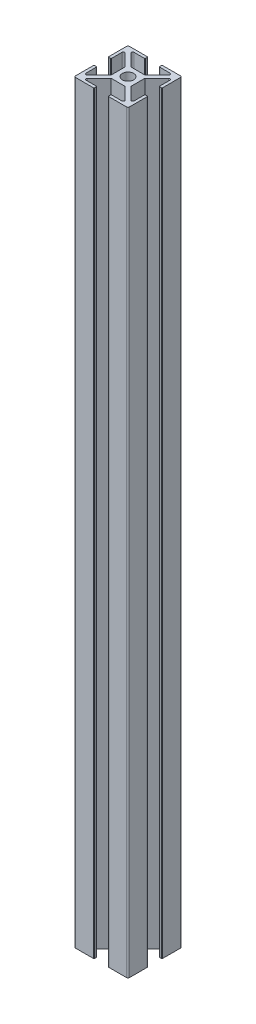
ISO-10303-21;
HEADER;
FILE_DESCRIPTION(('STEP AP214'),'2;1');
FILE_NAME('part.step','',(''),(''),'','','');
FILE_SCHEMA(('AUTOMOTIVE_DESIGN { 1 0 10303 214 1 1 1 1 }'));
ENDSEC;
DATA;
#1=APPLICATION_CONTEXT('core data for automotive mechanical design processes');
#2=APPLICATION_PROTOCOL_DEFINITION('international standard','automotive_design',2000,#1);
#3=PRODUCT_CONTEXT('',#1,'mechanical');
#4=PRODUCT('Part','Part','',(#3));
#5=PRODUCT_RELATED_PRODUCT_CATEGORY('part','',(#4));
#6=PRODUCT_DEFINITION_FORMATION('','',#4);
#7=PRODUCT_DEFINITION_CONTEXT('part definition',#1,'design');
#8=PRODUCT_DEFINITION('design','',#6,#7);
#9=PRODUCT_DEFINITION_SHAPE('','',#8);
#10=(LENGTH_UNIT() NAMED_UNIT(*) SI_UNIT(.MILLI.,.METRE.));
#11=(NAMED_UNIT(*) PLANE_ANGLE_UNIT() SI_UNIT($,.RADIAN.));
#12=(NAMED_UNIT(*) SI_UNIT($,.STERADIAN.) SOLID_ANGLE_UNIT());
#13=UNCERTAINTY_MEASURE_WITH_UNIT(LENGTH_MEASURE(1.E-05),#10,'distance_accuracy_value','');
#14=(GEOMETRIC_REPRESENTATION_CONTEXT(3) GLOBAL_UNCERTAINTY_ASSIGNED_CONTEXT((#13)) GLOBAL_UNIT_ASSIGNED_CONTEXT((#10,
#11,#12)) REPRESENTATION_CONTEXT('',''));
#15=CARTESIAN_POINT('',(0.,0.,0.));
#16=DIRECTION('',(0.,0.,1.));
#17=DIRECTION('',(1.,0.,0.));
#18=AXIS2_PLACEMENT_3D('',#15,#16,#17);
#19=CARTESIAN_POINT('',(0.,280.,-3.66));
#20=DIRECTION('',(0.,0.,-1.));
#21=DIRECTION('',(-1.,0.,0.));
#22=AXIS2_PLACEMENT_3D('',#19,#20,#21);
#23=PLANE('',#22);
#24=DIRECTION('',(1.,0.,0.));
#25=VECTOR('',#24,1.);
#26=CARTESIAN_POINT('',(0.,0.,-3.66));
#27=LINE('',#26,#25);
#28=CARTESIAN_POINT('',(-2.59933982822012,0.,-3.66));
#29=VERTEX_POINT('',#28);
#30=CARTESIAN_POINT('',(2.59933982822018,0.,-3.66));
#31=VERTEX_POINT('',#30);
#32=EDGE_CURVE('E669',#29,#31,#27,.T.);
#33=ORIENTED_EDGE('',*,*,#32,.F.);
#34=DIRECTION('',(0.,-1.,0.));
#35=VECTOR('',#34,1.);
#36=CARTESIAN_POINT('',(-2.59933982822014,280.,-3.66000000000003));
#37=LINE('',#36,#35);
#38=CARTESIAN_POINT('',(-2.59933982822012,280.,-3.66));
#39=VERTEX_POINT('',#38);
#40=EDGE_CURVE('E467',#39,#29,#37,.T.);
#41=ORIENTED_EDGE('',*,*,#40,.F.);
#42=DIRECTION('',(1.,0.,0.));
#43=VECTOR('',#42,1.);
#44=CARTESIAN_POINT('',(0.,280.,-3.66));
#45=LINE('',#44,#43);
#46=CARTESIAN_POINT('',(2.59933982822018,280.,-3.66));
#47=VERTEX_POINT('',#46);
#48=EDGE_CURVE('E455',#39,#47,#45,.T.);
#49=ORIENTED_EDGE('',*,*,#48,.T.);
#50=DIRECTION('',(0.,-1.,0.));
#51=VECTOR('',#50,1.);
#52=CARTESIAN_POINT('',(2.59933982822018,280.,-3.66));
#53=LINE('',#52,#51);
#54=EDGE_CURVE('E687',#47,#31,#53,.T.);
#55=ORIENTED_EDGE('',*,*,#54,.T.);
#56=EDGE_LOOP('',(#33,#41,#49,#55));
#57=FACE_BOUND('',#56,.T.);
#58=ADVANCED_FACE('F40',(#57),#23,.T.);
#59=CARTESIAN_POINT('',(-3.66,280.,0.));
#60=DIRECTION('',(-1.,0.,0.));
#61=DIRECTION('',(0.,0.,1.));
#62=AXIS2_PLACEMENT_3D('',#59,#60,#61);
#63=PLANE('',#62);
#64=DIRECTION('',(0.,0.,-1.));
#65=VECTOR('',#64,1.);
#66=CARTESIAN_POINT('',(-3.66,0.,0.));
#67=LINE('',#66,#65);
#68=CARTESIAN_POINT('',(-3.66000000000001,0.,2.59933982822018));
#69=VERTEX_POINT('',#68);
#70=CARTESIAN_POINT('',(-3.66,0.,-2.59933982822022));
#71=VERTEX_POINT('',#70);
#72=EDGE_CURVE('E671',#69,#71,#67,.T.);
#73=ORIENTED_EDGE('',*,*,#72,.F.);
#74=DIRECTION('',(0.,-1.,0.));
#75=VECTOR('',#74,1.);
#76=CARTESIAN_POINT('',(-3.66,280.,2.59933982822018));
#77=LINE('',#76,#75);
#78=CARTESIAN_POINT('',(-3.66000000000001,280.,2.59933982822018));
#79=VERTEX_POINT('',#78);
#80=EDGE_CURVE('E451',#79,#69,#77,.T.);
#81=ORIENTED_EDGE('',*,*,#80,.F.);
#82=DIRECTION('',(0.,0.,-1.));
#83=VECTOR('',#82,1.);
#84=CARTESIAN_POINT('',(-3.66,280.,0.));
#85=LINE('',#84,#83);
#86=CARTESIAN_POINT('',(-3.66,280.,-2.59933982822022));
#87=VERTEX_POINT('',#86);
#88=EDGE_CURVE('E444',#79,#87,#85,.T.);
#89=ORIENTED_EDGE('',*,*,#88,.T.);
#90=DIRECTION('',(0.,-1.,0.));
#91=VECTOR('',#90,1.);
#92=CARTESIAN_POINT('',(-3.65999999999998,280.,-2.59933982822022));
#93=LINE('',#92,#91);
#94=EDGE_CURVE('E448',#87,#71,#93,.T.);
#95=ORIENTED_EDGE('',*,*,#94,.T.);
#96=EDGE_LOOP('',(#73,#81,#89,#95));
#97=FACE_BOUND('',#96,.T.);
#98=ADVANCED_FACE('F447',(#97),#63,.T.);
#99=CARTESIAN_POINT('',(0.,280.,3.66));
#100=DIRECTION('',(0.,0.,-1.));
#101=DIRECTION('',(-1.,0.,0.));
#102=AXIS2_PLACEMENT_3D('',#99,#100,#101);
#103=PLANE('',#102);
#104=DIRECTION('',(0.,-1.,0.));
#105=VECTOR('',#104,1.);
#106=CARTESIAN_POINT('',(2.59933982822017,280.,3.66000000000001));
#107=LINE('',#106,#105);
#108=CARTESIAN_POINT('',(2.59933982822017,280.,3.66));
#109=VERTEX_POINT('',#108);
#110=CARTESIAN_POINT('',(2.59933982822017,0.,3.66));
#111=VERTEX_POINT('',#110);
#112=EDGE_CURVE('E589',#109,#111,#107,.T.);
#113=ORIENTED_EDGE('',*,*,#112,.F.);
#114=DIRECTION('',(1.,0.,0.));
#115=VECTOR('',#114,1.);
#116=CARTESIAN_POINT('',(0.,280.,3.66));
#117=LINE('',#116,#115);
#118=CARTESIAN_POINT('',(-2.59933982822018,280.,3.65999999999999));
#119=VERTEX_POINT('',#118);
#120=EDGE_CURVE('E454',#119,#109,#117,.T.);
#121=ORIENTED_EDGE('',*,*,#120,.F.);
#122=DIRECTION('',(0.,-1.,0.));
#123=VECTOR('',#122,1.);
#124=CARTESIAN_POINT('',(-2.59933982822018,280.,3.66));
#125=LINE('',#124,#123);
#126=CARTESIAN_POINT('',(-2.59933982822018,0.,3.66));
#127=VERTEX_POINT('',#126);
#128=EDGE_CURVE('E560',#119,#127,#125,.T.);
#129=ORIENTED_EDGE('',*,*,#128,.T.);
#130=DIRECTION('',(1.,0.,0.));
#131=VECTOR('',#130,1.);
#132=CARTESIAN_POINT('',(0.,0.,3.66));
#133=LINE('',#132,#131);
#134=EDGE_CURVE('E673',#127,#111,#133,.T.);
#135=ORIENTED_EDGE('',*,*,#134,.T.);
#136=EDGE_LOOP('',(#113,#121,#129,#135));
#137=FACE_BOUND('',#136,.T.);
#138=ADVANCED_FACE('F999',(#137),#103,.F.);
#139=CARTESIAN_POINT('',(10.,280.,0.));
#140=DIRECTION('',(1.,0.,0.));
#141=DIRECTION('',(0.,0.,-1.));
#142=AXIS2_PLACEMENT_3D('',#139,#140,#141);
#143=PLANE('',#142);
#144=DIRECTION('',(0.,0.,1.));
#145=VECTOR('',#144,1.);
#146=CARTESIAN_POINT('',(10.,280.,0.));
#147=LINE('',#146,#145);
#148=CARTESIAN_POINT('',(10.,280.,-9.50000000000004));
#149=VERTEX_POINT('',#148);
#150=CARTESIAN_POINT('',(10.,280.,-2.88));
#151=VERTEX_POINT('',#150);
#152=EDGE_CURVE('E621',#149,#151,#147,.T.);
#153=ORIENTED_EDGE('',*,*,#152,.T.);
#154=DIRECTION('',(0.,-1.,0.));
#155=VECTOR('',#154,1.);
#156=CARTESIAN_POINT('',(10.,0.,-2.88));
#157=LINE('',#156,#155);
#158=CARTESIAN_POINT('',(10.,0.,-2.88));
#159=VERTEX_POINT('',#158);
#160=EDGE_CURVE('E750',#151,#159,#157,.T.);
#161=ORIENTED_EDGE('',*,*,#160,.T.);
#162=DIRECTION('',(0.,0.,1.));
#163=VECTOR('',#162,1.);
#164=CARTESIAN_POINT('',(10.,0.,0.));
#165=LINE('',#164,#163);
#166=CARTESIAN_POINT('',(10.,0.,-9.50000000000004));
#167=VERTEX_POINT('',#166);
#168=EDGE_CURVE('E654',#167,#159,#165,.T.);
#169=ORIENTED_EDGE('',*,*,#168,.F.);
#170=DIRECTION('',(0.,-1.,0.));
#171=VECTOR('',#170,1.);
#172=CARTESIAN_POINT('',(10.,280.,-9.50000000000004));
#173=LINE('',#172,#171);
#174=EDGE_CURVE('E705',#167,#149,#173,.F.);
#175=ORIENTED_EDGE('',*,*,#174,.T.);
#176=EDGE_LOOP('',(#153,#161,#169,#175));
#177=FACE_BOUND('',#176,.T.);
#178=ADVANCED_FACE('F1019',(#177),#143,.T.);
#179=CARTESIAN_POINT('',(0.,280.,-10.));
#180=DIRECTION('',(0.,0.,1.));
#181=DIRECTION('',(1.,0.,0.));
#182=AXIS2_PLACEMENT_3D('',#179,#180,#181);
#183=PLANE('',#182);
#184=DIRECTION('',(-1.,0.,0.));
#185=VECTOR('',#184,1.);
#186=CARTESIAN_POINT('',(0.,0.,-10.));
#187=LINE('',#186,#185);
#188=CARTESIAN_POINT('',(9.50000000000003,0.,-10.));
#189=VERTEX_POINT('',#188);
#190=CARTESIAN_POINT('',(2.88,0.,-10.));
#191=VERTEX_POINT('',#190);
#192=EDGE_CURVE('E657',#189,#191,#187,.T.);
#193=ORIENTED_EDGE('',*,*,#192,.T.);
#194=DIRECTION('',(0.,-1.,0.));
#195=VECTOR('',#194,1.);
#196=CARTESIAN_POINT('',(2.88,280.,-10.));
#197=LINE('',#196,#195);
#198=CARTESIAN_POINT('',(2.88,280.,-10.));
#199=VERTEX_POINT('',#198);
#200=EDGE_CURVE('E730',#191,#199,#197,.F.);
#201=ORIENTED_EDGE('',*,*,#200,.T.);
#202=DIRECTION('',(-1.,0.,0.));
#203=VECTOR('',#202,1.);
#204=CARTESIAN_POINT('',(0.,280.,-10.));
#205=LINE('',#204,#203);
#206=CARTESIAN_POINT('',(9.50000000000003,280.,-10.));
#207=VERTEX_POINT('',#206);
#208=EDGE_CURVE('E625',#207,#199,#205,.T.);
#209=ORIENTED_EDGE('',*,*,#208,.F.);
#210=DIRECTION('',(0.,-1.,0.));
#211=VECTOR('',#210,1.);
#212=CARTESIAN_POINT('',(9.50000000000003,0.,-10.));
#213=LINE('',#212,#211);
#214=EDGE_CURVE('E700',#207,#189,#213,.T.);
#215=ORIENTED_EDGE('',*,*,#214,.T.);
#216=EDGE_LOOP('',(#193,#201,#209,#215));
#217=FACE_BOUND('',#216,.T.);
#218=ADVANCED_FACE('F1015',(#217),#183,.F.);
#219=CARTESIAN_POINT('',(2.63,280.,0.));
#220=DIRECTION('',(-1.,0.,0.));
#221=DIRECTION('',(0.,0.,1.));
#222=AXIS2_PLACEMENT_3D('',#219,#220,#221);
#223=PLANE('',#222);
#224=DIRECTION('',(0.,0.,-1.));
#225=VECTOR('',#224,1.);
#226=CARTESIAN_POINT('',(2.63,280.,0.));
#227=LINE('',#226,#225);
#228=CARTESIAN_POINT('',(2.63,280.,-9.18933982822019));
#229=VERTEX_POINT('',#228);
#230=CARTESIAN_POINT('',(2.63,280.,-9.75000000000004));
#231=VERTEX_POINT('',#230);
#232=EDGE_CURVE('E628',#229,#231,#227,.T.);
#233=ORIENTED_EDGE('',*,*,#232,.T.);
#234=DIRECTION('',(0.,-1.,0.));
#235=VECTOR('',#234,1.);
#236=CARTESIAN_POINT('',(2.63,0.,-9.75000000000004));
#237=LINE('',#236,#235);
#238=CARTESIAN_POINT('',(2.63,0.,-9.75000000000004));
#239=VERTEX_POINT('',#238);
#240=EDGE_CURVE('E719',#231,#239,#237,.T.);
#241=ORIENTED_EDGE('',*,*,#240,.T.);
#242=DIRECTION('',(0.,0.,-1.));
#243=VECTOR('',#242,1.);
#244=CARTESIAN_POINT('',(2.63,0.,0.));
#245=LINE('',#244,#243);
#246=CARTESIAN_POINT('',(2.63,0.,-9.18933982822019));
#247=VERTEX_POINT('',#246);
#248=EDGE_CURVE('E660',#247,#239,#245,.T.);
#249=ORIENTED_EDGE('',*,*,#248,.F.);
#250=DIRECTION('',(0.,-1.,0.));
#251=VECTOR('',#250,1.);
#252=CARTESIAN_POINT('',(2.63,280.,-9.18933982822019));
#253=LINE('',#252,#251);
#254=EDGE_CURVE('E717',#247,#229,#253,.F.);
#255=ORIENTED_EDGE('',*,*,#254,.T.);
#256=EDGE_LOOP('',(#233,#241,#249,#255));
#257=FACE_BOUND('',#256,.T.);
#258=ADVANCED_FACE('F1011',(#257),#223,.T.);
#259=CARTESIAN_POINT('',(0.,280.,-8.93933982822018));
#260=DIRECTION('',(0.,0.,1.));
#261=DIRECTION('',(1.,0.,0.));
#262=AXIS2_PLACEMENT_3D('',#259,#260,#261);
#263=PLANE('',#262);
#264=DIRECTION('',(-1.,0.,0.));
#265=VECTOR('',#264,1.);
#266=CARTESIAN_POINT('',(0.,280.,-8.93933982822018));
#267=LINE('',#266,#265);
#268=CARTESIAN_POINT('',(6.67157287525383,280.,-8.93933982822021));
#269=VERTEX_POINT('',#268);
#270=CARTESIAN_POINT('',(2.88,280.,-8.93933982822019));
#271=VERTEX_POINT('',#270);
#272=EDGE_CURVE('E631',#269,#271,#267,.T.);
#273=ORIENTED_EDGE('',*,*,#272,.T.);
#274=DIRECTION('',(0.,-1.,0.));
#275=VECTOR('',#274,1.);
#276=CARTESIAN_POINT('',(2.88,280.,-8.93933982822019));
#277=LINE('',#276,#275);
#278=CARTESIAN_POINT('',(2.88,0.,-8.93933982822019));
#279=VERTEX_POINT('',#278);
#280=EDGE_CURVE('E740',#271,#279,#277,.T.);
#281=ORIENTED_EDGE('',*,*,#280,.T.);
#282=DIRECTION('',(-1.,0.,0.));
#283=VECTOR('',#282,1.);
#284=CARTESIAN_POINT('',(0.,0.,-8.93933982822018));
#285=LINE('',#284,#283);
#286=CARTESIAN_POINT('',(6.67157287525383,0.,-8.93933982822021));
#287=VERTEX_POINT('',#286);
#288=EDGE_CURVE('E663',#287,#279,#285,.T.);
#289=ORIENTED_EDGE('',*,*,#288,.F.);
#290=DIRECTION('',(0.,-1.,0.));
#291=VECTOR('',#290,1.);
#292=CARTESIAN_POINT('',(6.67157287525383,280.,-8.93933982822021));
#293=LINE('',#292,#291);
#294=EDGE_CURVE('E693',#287,#269,#293,.F.);
#295=ORIENTED_EDGE('',*,*,#294,.T.);
#296=EDGE_LOOP('',(#273,#281,#289,#295));
#297=FACE_BOUND('',#296,.T.);
#298=ADVANCED_FACE('F1007',(#297),#263,.T.);
#299=CARTESIAN_POINT('',(-0.530330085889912,280.,-0.530330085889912));
#300=DIRECTION('',(-0.707106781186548,0.,-0.707106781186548));
#301=DIRECTION('',(-0.707106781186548,0.,0.707106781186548));
#302=AXIS2_PLACEMENT_3D('',#299,#300,#301);
#303=PLANE('',#302);
#304=DIRECTION('',(0.707106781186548,0.,-0.707106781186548));
#305=VECTOR('',#304,1.);
#306=CARTESIAN_POINT('',(-0.530330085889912,280.,-0.530330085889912));
#307=LINE('',#306,#305);
#308=CARTESIAN_POINT('',(7.02512626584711,280.,-8.08578643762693));
#309=VERTEX_POINT('',#308);
#310=EDGE_CURVE('E634',#47,#309,#307,.T.);
#311=ORIENTED_EDGE('',*,*,#310,.T.);
#312=DIRECTION('',(0.,-1.,0.));
#313=VECTOR('',#312,1.);
#314=CARTESIAN_POINT('',(7.02512626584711,0.,-8.08578643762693));
#315=LINE('',#314,#313);
#316=CARTESIAN_POINT('',(7.02512626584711,0.,-8.08578643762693));
#317=VERTEX_POINT('',#316);
#318=EDGE_CURVE('E690',#309,#317,#315,.T.);
#319=ORIENTED_EDGE('',*,*,#318,.T.);
#320=DIRECTION('',(0.707106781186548,0.,-0.707106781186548));
#321=VECTOR('',#320,1.);
#322=CARTESIAN_POINT('',(-0.530330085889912,0.,-0.530330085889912));
#323=LINE('',#322,#321);
#324=EDGE_CURVE('E666',#31,#317,#323,.T.);
#325=ORIENTED_EDGE('',*,*,#324,.F.);
#326=ORIENTED_EDGE('',*,*,#54,.F.);
#327=EDGE_LOOP('',(#311,#319,#325,#326));
#328=FACE_BOUND('',#327,.T.);
#329=ADVANCED_FACE('F1003',(#328),#303,.T.);
#330=CARTESIAN_POINT('',(3.66,280.,0.));
#331=DIRECTION('',(-1.,0.,0.));
#332=DIRECTION('',(0.,0.,1.));
#333=AXIS2_PLACEMENT_3D('',#330,#331,#332);
#334=PLANE('',#333);
#335=DIRECTION('',(0.,0.,-1.));
#336=VECTOR('',#335,1.);
#337=CARTESIAN_POINT('',(3.66,280.,0.));
#338=LINE('',#337,#336);
#339=CARTESIAN_POINT('',(3.66,280.,2.59933982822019));
#340=VERTEX_POINT('',#339);
#341=CARTESIAN_POINT('',(3.66,280.,-2.59933982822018));
#342=VERTEX_POINT('',#341);
#343=EDGE_CURVE('E640',#340,#342,#338,.T.);
#344=ORIENTED_EDGE('',*,*,#343,.F.);
#345=DIRECTION('',(0.,-1.,0.));
#346=VECTOR('',#345,1.);
#347=CARTESIAN_POINT('',(3.65999999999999,280.,2.59933982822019));
#348=LINE('',#347,#346);
#349=CARTESIAN_POINT('',(3.65999999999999,0.,2.59933982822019));
#350=VERTEX_POINT('',#349);
#351=EDGE_CURVE('E614',#340,#350,#348,.T.);
#352=ORIENTED_EDGE('',*,*,#351,.T.);
#353=DIRECTION('',(0.,0.,-1.));
#354=VECTOR('',#353,1.);
#355=CARTESIAN_POINT('',(3.66,0.,0.));
#356=LINE('',#355,#354);
#357=CARTESIAN_POINT('',(3.66,0.,-2.59933982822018));
#358=VERTEX_POINT('',#357);
#359=EDGE_CURVE('E675',#350,#358,#356,.T.);
#360=ORIENTED_EDGE('',*,*,#359,.T.);
#361=DIRECTION('',(0.,-1.,0.));
#362=VECTOR('',#361,1.);
#363=CARTESIAN_POINT('',(3.66,280.,-2.59933982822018));
#364=LINE('',#363,#362);
#365=EDGE_CURVE('E651',#342,#358,#364,.T.);
#366=ORIENTED_EDGE('',*,*,#365,.F.);
#367=EDGE_LOOP('',(#344,#352,#360,#366));
#368=FACE_BOUND('',#367,.T.);
#369=ADVANCED_FACE('F1006',(#368),#334,.F.);
#370=CARTESIAN_POINT('',(0.53033008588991,280.,0.53033008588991));
#371=DIRECTION('',(-0.707106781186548,0.,-0.707106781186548));
#372=DIRECTION('',(-0.707106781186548,0.,0.707106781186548));
#373=AXIS2_PLACEMENT_3D('',#370,#371,#372);
#374=PLANE('',#373);
#375=DIRECTION('',(0.707106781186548,0.,-0.707106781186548));
#376=VECTOR('',#375,1.);
#377=CARTESIAN_POINT('',(0.53033008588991,0.,0.53033008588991));
#378=LINE('',#377,#376);
#379=CARTESIAN_POINT('',(8.08578643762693,0.,-7.02512626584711));
#380=VERTEX_POINT('',#379);
#381=EDGE_CURVE('E677',#358,#380,#378,.T.);
#382=ORIENTED_EDGE('',*,*,#381,.T.);
#383=DIRECTION('',(0.,-1.,0.));
#384=VECTOR('',#383,1.);
#385=CARTESIAN_POINT('',(8.08578643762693,280.,-7.02512626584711));
#386=LINE('',#385,#384);
#387=CARTESIAN_POINT('',(8.08578643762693,280.,-7.02512626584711));
#388=VERTEX_POINT('',#387);
#389=EDGE_CURVE('E698',#380,#388,#386,.F.);
#390=ORIENTED_EDGE('',*,*,#389,.T.);
#391=DIRECTION('',(0.707106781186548,0.,-0.707106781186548));
#392=VECTOR('',#391,1.);
#393=CARTESIAN_POINT('',(0.53033008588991,280.,0.53033008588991));
#394=LINE('',#393,#392);
#395=EDGE_CURVE('E642',#342,#388,#394,.T.);
#396=ORIENTED_EDGE('',*,*,#395,.F.);
#397=ORIENTED_EDGE('',*,*,#365,.T.);
#398=EDGE_LOOP('',(#382,#390,#396,#397));
#399=FACE_BOUND('',#398,.T.);
#400=ADVANCED_FACE('F1213',(#399),#374,.F.);
#401=CARTESIAN_POINT('',(8.93933982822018,280.,0.));
#402=DIRECTION('',(1.,0.,0.));
#403=DIRECTION('',(0.,0.,-1.));
#404=AXIS2_PLACEMENT_3D('',#401,#402,#403);
#405=PLANE('',#404);
#406=DIRECTION('',(0.,0.,1.));
#407=VECTOR('',#406,1.);
#408=CARTESIAN_POINT('',(8.93933982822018,0.,0.));
#409=LINE('',#408,#407);
#410=CARTESIAN_POINT('',(8.9393398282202,0.,-6.67157287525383));
#411=VERTEX_POINT('',#410);
#412=CARTESIAN_POINT('',(8.93933982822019,0.,-2.88000000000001));
#413=VERTEX_POINT('',#412);
#414=EDGE_CURVE('E680',#411,#413,#409,.T.);
#415=ORIENTED_EDGE('',*,*,#414,.T.);
#416=DIRECTION('',(0.,-1.,0.));
#417=VECTOR('',#416,1.);
#418=CARTESIAN_POINT('',(8.93933982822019,280.,-2.88000000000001));
#419=LINE('',#418,#417);
#420=CARTESIAN_POINT('',(8.93933982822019,280.,-2.88000000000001));
#421=VERTEX_POINT('',#420);
#422=EDGE_CURVE('E748',#413,#421,#419,.F.);
#423=ORIENTED_EDGE('',*,*,#422,.T.);
#424=DIRECTION('',(0.,0.,1.));
#425=VECTOR('',#424,1.);
#426=CARTESIAN_POINT('',(8.93933982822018,280.,0.));
#427=LINE('',#426,#425);
#428=CARTESIAN_POINT('',(8.9393398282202,280.,-6.67157287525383));
#429=VERTEX_POINT('',#428);
#430=EDGE_CURVE('E645',#429,#421,#427,.T.);
#431=ORIENTED_EDGE('',*,*,#430,.F.);
#432=DIRECTION('',(0.,-1.,0.));
#433=VECTOR('',#432,1.);
#434=CARTESIAN_POINT('',(8.9393398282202,0.,-6.67157287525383));
#435=LINE('',#434,#433);
#436=EDGE_CURVE('E695',#429,#411,#435,.T.);
#437=ORIENTED_EDGE('',*,*,#436,.T.);
#438=EDGE_LOOP('',(#415,#423,#431,#437));
#439=FACE_BOUND('',#438,.T.);
#440=ADVANCED_FACE('F1028',(#439),#405,.F.);
#441=CARTESIAN_POINT('',(0.,280.,0.));
#442=DIRECTION('',(0.,-1.,0.));
#443=DIRECTION('',(0.,0.,-1.));
#444=AXIS2_PLACEMENT_3D('',#441,#442,#443);
#445=CYLINDRICAL_SURFACE('',#444,2.095);
#446=CARTESIAN_POINT('',(0.,280.,0.));
#447=DIRECTION('',(0.,1.,0.));
#448=DIRECTION('',(0.,0.,1.));
#449=AXIS2_PLACEMENT_3D('',#446,#447,#448);
#450=CIRCLE('',#449,2.095);
#451=CARTESIAN_POINT('',(0.,280.,2.095));
#452=VERTEX_POINT('',#451);
#453=EDGE_CURVE('E618',#452,#452,#450,.T.);
#454=ORIENTED_EDGE('',*,*,#453,.T.);
#455=EDGE_LOOP('',(#454));
#456=FACE_BOUND('',#455,.T.);
#457=CARTESIAN_POINT('',(0.,0.,0.));
#458=DIRECTION('',(0.,1.,0.));
#459=DIRECTION('',(0.,0.,1.));
#460=AXIS2_PLACEMENT_3D('',#457,#458,#459);
#461=CIRCLE('',#460,2.095);
#462=CARTESIAN_POINT('',(0.,0.,2.095));
#463=VERTEX_POINT('',#462);
#464=EDGE_CURVE('E617',#463,#463,#461,.T.);
#465=ORIENTED_EDGE('',*,*,#464,.F.);
#466=EDGE_LOOP('',(#465));
#467=FACE_BOUND('',#466,.T.);
#468=ADVANCED_FACE('F1024',(#456,#467),#445,.F.);
#469=CARTESIAN_POINT('',(0.,280.,-2.63000000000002));
#470=DIRECTION('',(0.,0.,-1.));
#471=DIRECTION('',(-1.,0.,0.));
#472=AXIS2_PLACEMENT_3D('',#469,#470,#471);
#473=PLANE('',#472);
#474=DIRECTION('',(1.,0.,0.));
#475=VECTOR('',#474,1.);
#476=CARTESIAN_POINT('',(0.,280.,-2.63000000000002));
#477=LINE('',#476,#475);
#478=CARTESIAN_POINT('',(9.18933982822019,280.,-2.63000000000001));
#479=VERTEX_POINT('',#478);
#480=CARTESIAN_POINT('',(9.75000000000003,280.,-2.63));
#481=VERTEX_POINT('',#480);
#482=EDGE_CURVE('E648',#479,#481,#477,.T.);
#483=ORIENTED_EDGE('',*,*,#482,.F.);
#484=DIRECTION('',(0.,-1.,0.));
#485=VECTOR('',#484,1.);
#486=CARTESIAN_POINT('',(9.18933982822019,280.,-2.63000000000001));
#487=LINE('',#486,#485);
#488=CARTESIAN_POINT('',(9.18933982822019,0.,-2.63000000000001));
#489=VERTEX_POINT('',#488);
#490=EDGE_CURVE('E745',#479,#489,#487,.T.);
#491=ORIENTED_EDGE('',*,*,#490,.T.);
#492=DIRECTION('',(1.,0.,0.));
#493=VECTOR('',#492,1.);
#494=CARTESIAN_POINT('',(0.,0.,-2.63000000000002));
#495=LINE('',#494,#493);
#496=CARTESIAN_POINT('',(9.75000000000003,0.,-2.63));
#497=VERTEX_POINT('',#496);
#498=EDGE_CURVE('E622',#489,#497,#495,.T.);
#499=ORIENTED_EDGE('',*,*,#498,.T.);
#500=DIRECTION('',(0.,-1.,0.));
#501=VECTOR('',#500,1.);
#502=CARTESIAN_POINT('',(9.75000000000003,280.,-2.63));
#503=LINE('',#502,#501);
#504=EDGE_CURVE('E743',#497,#481,#503,.F.);
#505=ORIENTED_EDGE('',*,*,#504,.T.);
#506=EDGE_LOOP('',(#483,#491,#499,#505));
#507=FACE_BOUND('',#506,.T.);
#508=ADVANCED_FACE('F1027',(#507),#473,.F.);
#509=CARTESIAN_POINT('',(0.,280.,0.));
#510=DIRECTION('',(0.,1.,0.));
#511=DIRECTION('',(0.,0.,1.));
#512=AXIS2_PLACEMENT_3D('',#509,#510,#511);
#513=PLANE('',#512);
#514=DIRECTION('',(0.,0.,1.));
#515=VECTOR('',#514,1.);
#516=CARTESIAN_POINT('',(-10.,280.,-1.04744440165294E-13));
#517=LINE('',#516,#515);
#518=CARTESIAN_POINT('',(-9.99999999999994,280.,-9.50000000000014));
#519=VERTEX_POINT('',#518);
#520=CARTESIAN_POINT('',(-10.,280.,-2.88000000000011));
#521=VERTEX_POINT('',#520);
#522=EDGE_CURVE('E958',#519,#521,#517,.T.);
#523=ORIENTED_EDGE('',*,*,#522,.T.);
#524=CARTESIAN_POINT('',(-9.75000000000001,280.,-2.8800000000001));
#525=DIRECTION('',(0.,1.,0.));
#526=DIRECTION('',(0.,0.,1.));
#527=AXIS2_PLACEMENT_3D('',#524,#525,#526);
#528=CIRCLE('',#527,0.25);
#529=CARTESIAN_POINT('',(-9.75000000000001,280.,-2.6300000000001));
#530=VERTEX_POINT('',#529);
#531=EDGE_CURVE('E923',#521,#530,#528,.T.);
#532=ORIENTED_EDGE('',*,*,#531,.T.);
#533=DIRECTION('',(-1.,0.,0.));
#534=VECTOR('',#533,1.);
#535=CARTESIAN_POINT('',(0.,280.,-2.63));
#536=LINE('',#535,#534);
#537=CARTESIAN_POINT('',(-9.18933982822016,280.,-2.6300000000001));
#538=VERTEX_POINT('',#537);
#539=EDGE_CURVE('E480',#538,#530,#536,.T.);
#540=ORIENTED_EDGE('',*,*,#539,.F.);
#541=CARTESIAN_POINT('',(-9.18933982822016,280.,-2.8800000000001));
#542=DIRECTION('',(0.,1.,0.));
#543=DIRECTION('',(0.,0.,1.));
#544=AXIS2_PLACEMENT_3D('',#541,#542,#543);
#545=CIRCLE('',#544,0.25);
#546=CARTESIAN_POINT('',(-8.93933982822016,280.,-2.8800000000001));
#547=VERTEX_POINT('',#546);
#548=EDGE_CURVE('E55',#538,#547,#545,.T.);
#549=ORIENTED_EDGE('',*,*,#548,.T.);
#550=DIRECTION('',(0.,0.,1.));
#551=VECTOR('',#550,1.);
#552=CARTESIAN_POINT('',(-8.93933982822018,280.,0.));
#553=LINE('',#552,#551);
#554=CARTESIAN_POINT('',(-8.93933982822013,280.,-6.67157287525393));
#555=VERTEX_POINT('',#554);
#556=EDGE_CURVE('E475',#555,#547,#553,.T.);
#557=ORIENTED_EDGE('',*,*,#556,.F.);
#558=CARTESIAN_POINT('',(-8.43933982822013,280.,-6.67157287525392));
#559=DIRECTION('',(0.,1.,0.));
#560=DIRECTION('',(0.,0.,1.));
#561=AXIS2_PLACEMENT_3D('',#558,#559,#560);
#562=CIRCLE('',#561,0.5);
#563=CARTESIAN_POINT('',(-8.08578643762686,280.,-7.02512626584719));
#564=VERTEX_POINT('',#563);
#565=EDGE_CURVE('E473',#555,#564,#562,.F.);
#566=ORIENTED_EDGE('',*,*,#565,.T.);
#567=DIRECTION('',(-0.70710678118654,0.,-0.707106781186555));
#568=VECTOR('',#567,1.);
#569=CARTESIAN_POINT('',(-0.530330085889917,280.,0.530330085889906));
#570=LINE('',#569,#568);
#571=EDGE_CURVE('E462',#87,#564,#570,.T.);
#572=ORIENTED_EDGE('',*,*,#571,.F.);
#573=ORIENTED_EDGE('',*,*,#88,.F.);
#574=DIRECTION('',(-0.707106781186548,0.,0.707106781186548));
#575=VECTOR('',#574,1.);
#576=CARTESIAN_POINT('',(-0.53033008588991,280.,-0.53033008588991));
#577=LINE('',#576,#575);
#578=CARTESIAN_POINT('',(-8.08578643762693,280.,7.02512626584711));
#579=VERTEX_POINT('',#578);
#580=EDGE_CURVE('E529',#79,#579,#577,.T.);
#581=ORIENTED_EDGE('',*,*,#580,.T.);
#582=CARTESIAN_POINT('',(-8.4393398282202,280.,6.67157287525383));
#583=DIRECTION('',(0.,1.,0.));
#584=DIRECTION('',(0.,0.,1.));
#585=AXIS2_PLACEMENT_3D('',#582,#583,#584);
#586=CIRCLE('',#585,0.5);
#587=CARTESIAN_POINT('',(-8.9393398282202,280.,6.67157287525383));
#588=VERTEX_POINT('',#587);
#589=EDGE_CURVE('E805',#579,#588,#586,.F.);
#590=ORIENTED_EDGE('',*,*,#589,.T.);
#591=DIRECTION('',(0.,0.,-1.));
#592=VECTOR('',#591,1.);
#593=CARTESIAN_POINT('',(-8.93933982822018,280.,0.));
#594=LINE('',#593,#592);
#595=CARTESIAN_POINT('',(-8.93933982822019,280.,2.88000000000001));
#596=VERTEX_POINT('',#595);
#597=EDGE_CURVE('E531',#588,#596,#594,.T.);
#598=ORIENTED_EDGE('',*,*,#597,.T.);
#599=CARTESIAN_POINT('',(-9.18933982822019,280.,2.88000000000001));
#600=DIRECTION('',(0.,1.,0.));
#601=DIRECTION('',(0.,0.,1.));
#602=AXIS2_PLACEMENT_3D('',#599,#600,#601);
#603=CIRCLE('',#602,0.25);
#604=CARTESIAN_POINT('',(-9.18933982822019,280.,2.63000000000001));
#605=VERTEX_POINT('',#604);
#606=EDGE_CURVE('E885',#596,#605,#603,.T.);
#607=ORIENTED_EDGE('',*,*,#606,.T.);
#608=DIRECTION('',(-1.,0.,0.));
#609=VECTOR('',#608,1.);
#610=CARTESIAN_POINT('',(0.,280.,2.63000000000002));
#611=LINE('',#610,#609);
#612=CARTESIAN_POINT('',(-9.75000000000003,280.,2.63));
#613=VERTEX_POINT('',#612);
#614=EDGE_CURVE('E534',#605,#613,#611,.T.);
#615=ORIENTED_EDGE('',*,*,#614,.T.);
#616=CARTESIAN_POINT('',(-9.75000000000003,280.,2.88));
#617=DIRECTION('',(0.,1.,0.));
#618=DIRECTION('',(0.,0.,1.));
#619=AXIS2_PLACEMENT_3D('',#616,#617,#618);
#620=CIRCLE('',#619,0.25);
#621=CARTESIAN_POINT('',(-10.,280.,2.88));
#622=VERTEX_POINT('',#621);
#623=EDGE_CURVE('E883',#613,#622,#620,.T.);
#624=ORIENTED_EDGE('',*,*,#623,.T.);
#625=DIRECTION('',(0.,0.,-1.));
#626=VECTOR('',#625,1.);
#627=CARTESIAN_POINT('',(-10.,280.,0.));
#628=LINE('',#627,#626);
#629=CARTESIAN_POINT('',(-10.,280.,9.50000000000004));
#630=VERTEX_POINT('',#629);
#631=EDGE_CURVE('E513',#630,#622,#628,.T.);
#632=ORIENTED_EDGE('',*,*,#631,.F.);
#633=CARTESIAN_POINT('',(-9.50000000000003,280.,9.50000000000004));
#634=DIRECTION('',(0.,1.,0.));
#635=DIRECTION('',(0.,0.,1.));
#636=AXIS2_PLACEMENT_3D('',#633,#634,#635);
#637=CIRCLE('',#636,0.5);
#638=CARTESIAN_POINT('',(-9.50000000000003,280.,10.));
#639=VERTEX_POINT('',#638);
#640=EDGE_CURVE('E797',#630,#639,#637,.T.);
#641=ORIENTED_EDGE('',*,*,#640,.T.);
#642=DIRECTION('',(1.,0.,0.));
#643=VECTOR('',#642,1.);
#644=CARTESIAN_POINT('',(0.,280.,10.));
#645=LINE('',#644,#643);
#646=CARTESIAN_POINT('',(-2.88,280.,10.));
#647=VERTEX_POINT('',#646);
#648=EDGE_CURVE('E516',#639,#647,#645,.T.);
#649=ORIENTED_EDGE('',*,*,#648,.T.);
#650=CARTESIAN_POINT('',(-2.88,280.,9.75000000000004));
#651=DIRECTION('',(0.,1.,0.));
#652=DIRECTION('',(0.,0.,1.));
#653=AXIS2_PLACEMENT_3D('',#650,#651,#652);
#654=CIRCLE('',#653,0.25);
#655=CARTESIAN_POINT('',(-2.63,280.,9.75000000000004));
#656=VERTEX_POINT('',#655);
#657=EDGE_CURVE('E889',#647,#656,#654,.T.);
#658=ORIENTED_EDGE('',*,*,#657,.T.);
#659=DIRECTION('',(0.,0.,1.));
#660=VECTOR('',#659,1.);
#661=CARTESIAN_POINT('',(-2.63,280.,0.));
#662=LINE('',#661,#660);
#663=CARTESIAN_POINT('',(-2.63,280.,9.18933982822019));
#664=VERTEX_POINT('',#663);
#665=EDGE_CURVE('E520',#664,#656,#662,.T.);
#666=ORIENTED_EDGE('',*,*,#665,.F.);
#667=CARTESIAN_POINT('',(-2.88,280.,9.18933982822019));
#668=DIRECTION('',(0.,1.,0.));
#669=DIRECTION('',(0.,0.,1.));
#670=AXIS2_PLACEMENT_3D('',#667,#668,#669);
#671=CIRCLE('',#670,0.25);
#672=CARTESIAN_POINT('',(-2.88,280.,8.93933982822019));
#673=VERTEX_POINT('',#672);
#674=EDGE_CURVE('E887',#664,#673,#671,.T.);
#675=ORIENTED_EDGE('',*,*,#674,.T.);
#676=DIRECTION('',(1.,0.,0.));
#677=VECTOR('',#676,1.);
#678=CARTESIAN_POINT('',(0.,280.,8.93933982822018));
#679=LINE('',#678,#677);
#680=CARTESIAN_POINT('',(-6.67157287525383,280.,8.93933982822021));
#681=VERTEX_POINT('',#680);
#682=EDGE_CURVE('E523',#681,#673,#679,.T.);
#683=ORIENTED_EDGE('',*,*,#682,.F.);
#684=CARTESIAN_POINT('',(-6.67157287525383,280.,8.4393398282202));
#685=DIRECTION('',(0.,1.,0.));
#686=DIRECTION('',(0.,0.,1.));
#687=AXIS2_PLACEMENT_3D('',#684,#685,#686);
#688=CIRCLE('',#687,0.5);
#689=CARTESIAN_POINT('',(-7.02512626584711,280.,8.08578643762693));
#690=VERTEX_POINT('',#689);
#691=EDGE_CURVE('E801',#681,#690,#688,.F.);
#692=ORIENTED_EDGE('',*,*,#691,.T.);
#693=DIRECTION('',(-0.707106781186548,0.,0.707106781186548));
#694=VECTOR('',#693,1.);
#695=CARTESIAN_POINT('',(0.530330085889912,280.,0.530330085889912));
#696=LINE('',#695,#694);
#697=EDGE_CURVE('E526',#119,#690,#696,.T.);
#698=ORIENTED_EDGE('',*,*,#697,.F.);
#699=ORIENTED_EDGE('',*,*,#120,.T.);
#700=DIRECTION('',(0.707106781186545,0.,0.70710678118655));
#701=VECTOR('',#700,1.);
#702=CARTESIAN_POINT('',(-0.530330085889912,280.,0.530330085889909));
#703=LINE('',#702,#701);
#704=CARTESIAN_POINT('',(7.02512626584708,280.,8.08578643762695));
#705=VERTEX_POINT('',#704);
#706=EDGE_CURVE('E580',#109,#705,#703,.T.);
#707=ORIENTED_EDGE('',*,*,#706,.T.);
#708=CARTESIAN_POINT('',(6.67157287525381,280.,8.43933982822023));
#709=DIRECTION('',(0.,1.,0.));
#710=DIRECTION('',(0.,0.,1.));
#711=AXIS2_PLACEMENT_3D('',#708,#709,#710);
#712=CIRCLE('',#711,0.5);
#713=CARTESIAN_POINT('',(6.6715728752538,280.,8.93933982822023));
#714=VERTEX_POINT('',#713);
#715=EDGE_CURVE('E778',#705,#714,#712,.F.);
#716=ORIENTED_EDGE('',*,*,#715,.T.);
#717=DIRECTION('',(-1.,0.,0.));
#718=VECTOR('',#717,1.);
#719=CARTESIAN_POINT('',(0.,280.,8.93933982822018));
#720=LINE('',#719,#718);
#721=CARTESIAN_POINT('',(2.87999999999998,280.,8.9393398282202));
#722=VERTEX_POINT('',#721);
#723=EDGE_CURVE('E583',#714,#722,#720,.T.);
#724=ORIENTED_EDGE('',*,*,#723,.T.);
#725=CARTESIAN_POINT('',(2.87999999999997,280.,9.1893398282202));
#726=DIRECTION('',(0.,1.,0.));
#727=DIRECTION('',(0.,0.,1.));
#728=AXIS2_PLACEMENT_3D('',#725,#726,#727);
#729=CIRCLE('',#728,0.25);
#730=CARTESIAN_POINT('',(2.62999999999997,280.,9.1893398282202));
#731=VERTEX_POINT('',#730);
#732=EDGE_CURVE('E849',#722,#731,#729,.T.);
#733=ORIENTED_EDGE('',*,*,#732,.T.);
#734=DIRECTION('',(0.,0.,1.));
#735=VECTOR('',#734,1.);
#736=CARTESIAN_POINT('',(2.63000000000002,280.,0.));
#737=LINE('',#736,#735);
#738=CARTESIAN_POINT('',(2.62999999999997,280.,9.75000000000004));
#739=VERTEX_POINT('',#738);
#740=EDGE_CURVE('E586',#731,#739,#737,.T.);
#741=ORIENTED_EDGE('',*,*,#740,.T.);
#742=CARTESIAN_POINT('',(2.87999999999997,280.,9.75000000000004));
#743=DIRECTION('',(0.,1.,0.));
#744=DIRECTION('',(0.,0.,1.));
#745=AXIS2_PLACEMENT_3D('',#742,#743,#744);
#746=CIRCLE('',#745,0.25);
#747=CARTESIAN_POINT('',(2.87999999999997,280.,10.));
#748=VERTEX_POINT('',#747);
#749=EDGE_CURVE('E847',#739,#748,#746,.T.);
#750=ORIENTED_EDGE('',*,*,#749,.T.);
#751=DIRECTION('',(-1.,0.,0.));
#752=VECTOR('',#751,1.);
#753=CARTESIAN_POINT('',(0.,280.,10.));
#754=LINE('',#753,#752);
#755=CARTESIAN_POINT('',(9.5,280.,10.0000000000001));
#756=VERTEX_POINT('',#755);
#757=EDGE_CURVE('E564',#756,#748,#754,.T.);
#758=ORIENTED_EDGE('',*,*,#757,.F.);
#759=CARTESIAN_POINT('',(9.5,280.,9.50000000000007));
#760=DIRECTION('',(0.,1.,0.));
#761=DIRECTION('',(0.,0.,1.));
#762=AXIS2_PLACEMENT_3D('',#759,#760,#761);
#763=CIRCLE('',#762,0.5);
#764=CARTESIAN_POINT('',(10.,280.,9.50000000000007));
#765=VERTEX_POINT('',#764);
#766=EDGE_CURVE('E770',#756,#765,#763,.T.);
#767=ORIENTED_EDGE('',*,*,#766,.T.);
#768=DIRECTION('',(0.,0.,-1.));
#769=VECTOR('',#768,1.);
#770=CARTESIAN_POINT('',(10.,280.,0.));
#771=LINE('',#770,#769);
#772=CARTESIAN_POINT('',(10.,280.,2.88000000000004));
#773=VERTEX_POINT('',#772);
#774=EDGE_CURVE('E567',#765,#773,#771,.T.);
#775=ORIENTED_EDGE('',*,*,#774,.T.);
#776=CARTESIAN_POINT('',(9.75000000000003,280.,2.88000000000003));
#777=DIRECTION('',(0.,1.,0.));
#778=DIRECTION('',(0.,0.,1.));
#779=AXIS2_PLACEMENT_3D('',#776,#777,#778);
#780=CIRCLE('',#779,0.25);
#781=CARTESIAN_POINT('',(9.75000000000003,280.,2.63000000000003));
#782=VERTEX_POINT('',#781);
#783=EDGE_CURVE('E853',#773,#782,#780,.T.);
#784=ORIENTED_EDGE('',*,*,#783,.T.);
#785=DIRECTION('',(1.,0.,0.));
#786=VECTOR('',#785,1.);
#787=CARTESIAN_POINT('',(0.,280.,2.63));
#788=LINE('',#787,#786);
#789=CARTESIAN_POINT('',(9.18933982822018,280.,2.63000000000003));
#790=VERTEX_POINT('',#789);
#791=EDGE_CURVE('E571',#790,#782,#788,.T.);
#792=ORIENTED_EDGE('',*,*,#791,.F.);
#793=CARTESIAN_POINT('',(9.18933982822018,280.,2.88000000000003));
#794=DIRECTION('',(0.,1.,0.));
#795=DIRECTION('',(0.,0.,1.));
#796=AXIS2_PLACEMENT_3D('',#793,#794,#795);
#797=CIRCLE('',#796,0.25);
#798=CARTESIAN_POINT('',(8.93933982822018,280.,2.88000000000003));
#799=VERTEX_POINT('',#798);
#800=EDGE_CURVE('E851',#790,#799,#797,.T.);
#801=ORIENTED_EDGE('',*,*,#800,.T.);
#802=DIRECTION('',(0.,0.,-1.));
#803=VECTOR('',#802,1.);
#804=CARTESIAN_POINT('',(8.93933982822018,280.,0.));
#805=LINE('',#804,#803);
#806=CARTESIAN_POINT('',(8.93933982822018,280.,6.67157287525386));
#807=VERTEX_POINT('',#806);
#808=EDGE_CURVE('E574',#807,#799,#805,.T.);
#809=ORIENTED_EDGE('',*,*,#808,.F.);
#810=CARTESIAN_POINT('',(8.43933982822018,280.,6.67157287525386));
#811=DIRECTION('',(0.,1.,0.));
#812=DIRECTION('',(0.,0.,1.));
#813=AXIS2_PLACEMENT_3D('',#810,#811,#812);
#814=CIRCLE('',#813,0.5);
#815=CARTESIAN_POINT('',(8.08578643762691,280.,7.02512626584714));
#816=VERTEX_POINT('',#815);
#817=EDGE_CURVE('E774',#807,#816,#814,.F.);
#818=ORIENTED_EDGE('',*,*,#817,.T.);
#819=DIRECTION('',(0.707106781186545,0.,0.70710678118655));
#820=VECTOR('',#819,1.);
#821=CARTESIAN_POINT('',(0.530330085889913,280.,-0.53033008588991));
#822=LINE('',#821,#820);
#823=EDGE_CURVE('E577',#340,#816,#822,.T.);
#824=ORIENTED_EDGE('',*,*,#823,.F.);
#825=ORIENTED_EDGE('',*,*,#343,.T.);
#826=ORIENTED_EDGE('',*,*,#395,.T.);
#827=CARTESIAN_POINT('',(8.4393398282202,280.,-6.67157287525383));
#828=DIRECTION('',(0.,1.,0.));
#829=DIRECTION('',(0.,0.,1.));
#830=AXIS2_PLACEMENT_3D('',#827,#828,#829);
#831=CIRCLE('',#830,0.5);
#832=EDGE_CURVE('E715',#388,#429,#831,.F.);
#833=ORIENTED_EDGE('',*,*,#832,.T.);
#834=ORIENTED_EDGE('',*,*,#430,.T.);
#835=CARTESIAN_POINT('',(9.18933982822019,280.,-2.88000000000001));
#836=DIRECTION('',(0.,1.,0.));
#837=DIRECTION('',(0.,0.,1.));
#838=AXIS2_PLACEMENT_3D('',#835,#836,#837);
#839=CIRCLE('',#838,0.25);
#840=EDGE_CURVE('E734',#421,#479,#839,.T.);
#841=ORIENTED_EDGE('',*,*,#840,.T.);
#842=ORIENTED_EDGE('',*,*,#482,.T.);
#843=CARTESIAN_POINT('',(9.75000000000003,280.,-2.88));
#844=DIRECTION('',(0.,1.,0.));
#845=DIRECTION('',(0.,0.,1.));
#846=AXIS2_PLACEMENT_3D('',#843,#844,#845);
#847=CIRCLE('',#846,0.25);
#848=EDGE_CURVE('E732',#481,#151,#847,.T.);
#849=ORIENTED_EDGE('',*,*,#848,.T.);
#850=ORIENTED_EDGE('',*,*,#152,.F.);
#851=CARTESIAN_POINT('',(9.50000000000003,280.,-9.50000000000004));
#852=DIRECTION('',(0.,1.,0.));
#853=DIRECTION('',(0.,0.,1.));
#854=AXIS2_PLACEMENT_3D('',#851,#852,#853);
#855=CIRCLE('',#854,0.5);
#856=EDGE_CURVE('E707',#149,#207,#855,.T.);
#857=ORIENTED_EDGE('',*,*,#856,.T.);
#858=ORIENTED_EDGE('',*,*,#208,.T.);
#859=CARTESIAN_POINT('',(2.88,280.,-9.75000000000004));
#860=DIRECTION('',(0.,1.,0.));
#861=DIRECTION('',(0.,0.,1.));
#862=AXIS2_PLACEMENT_3D('',#859,#860,#861);
#863=CIRCLE('',#862,0.25);
#864=EDGE_CURVE('E738',#199,#231,#863,.T.);
#865=ORIENTED_EDGE('',*,*,#864,.T.);
#866=ORIENTED_EDGE('',*,*,#232,.F.);
#867=CARTESIAN_POINT('',(2.88,280.,-9.18933982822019));
#868=DIRECTION('',(0.,1.,0.));
#869=DIRECTION('',(0.,0.,1.));
#870=AXIS2_PLACEMENT_3D('',#867,#868,#869);
#871=CIRCLE('',#870,0.25);
#872=EDGE_CURVE('E736',#229,#271,#871,.T.);
#873=ORIENTED_EDGE('',*,*,#872,.T.);
#874=ORIENTED_EDGE('',*,*,#272,.F.);
#875=CARTESIAN_POINT('',(6.67157287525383,280.,-8.4393398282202));
#876=DIRECTION('',(0.,1.,0.));
#877=DIRECTION('',(0.,0.,1.));
#878=AXIS2_PLACEMENT_3D('',#875,#876,#877);
#879=CIRCLE('',#878,0.5);
#880=EDGE_CURVE('E711',#269,#309,#879,.F.);
#881=ORIENTED_EDGE('',*,*,#880,.T.);
#882=ORIENTED_EDGE('',*,*,#310,.F.);
#883=ORIENTED_EDGE('',*,*,#48,.F.);
#884=DIRECTION('',(-0.70710678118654,0.,-0.707106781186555));
#885=VECTOR('',#884,1.);
#886=CARTESIAN_POINT('',(0.530330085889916,280.,-0.530330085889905));
#887=LINE('',#886,#885);
#888=CARTESIAN_POINT('',(-7.02512626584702,280.,-8.085786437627));
#889=VERTEX_POINT('',#888);
#890=EDGE_CURVE('E474',#39,#889,#887,.T.);
#891=ORIENTED_EDGE('',*,*,#890,.T.);
#892=CARTESIAN_POINT('',(-6.67157287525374,280.,-8.43933982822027));
#893=DIRECTION('',(0.,1.,0.));
#894=DIRECTION('',(0.,0.,1.));
#895=AXIS2_PLACEMENT_3D('',#892,#893,#894);
#896=CIRCLE('',#895,0.5);
#897=CARTESIAN_POINT('',(-6.67157287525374,280.,-8.93933982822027));
#898=VERTEX_POINT('',#897);
#899=EDGE_CURVE('E830',#889,#898,#896,.F.);
#900=ORIENTED_EDGE('',*,*,#899,.T.);
#901=DIRECTION('',(1.,0.,0.));
#902=VECTOR('',#901,1.);
#903=CARTESIAN_POINT('',(1.25196248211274E-13,280.,-8.93933982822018));
#904=LINE('',#903,#902);
#905=CARTESIAN_POINT('',(-2.87999999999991,280.,-8.93933982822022));
#906=VERTEX_POINT('',#905);
#907=EDGE_CURVE('E478',#898,#906,#904,.T.);
#908=ORIENTED_EDGE('',*,*,#907,.T.);
#909=CARTESIAN_POINT('',(-2.87999999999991,280.,-9.18933982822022));
#910=DIRECTION('',(0.,1.,0.));
#911=DIRECTION('',(0.,0.,1.));
#912=AXIS2_PLACEMENT_3D('',#909,#910,#911);
#913=CIRCLE('',#912,0.25);
#914=CARTESIAN_POINT('',(-2.62999999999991,280.,-9.18933982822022));
#915=VERTEX_POINT('',#914);
#916=EDGE_CURVE('E920',#906,#915,#913,.T.);
#917=ORIENTED_EDGE('',*,*,#916,.T.);
#918=DIRECTION('',(0.,0.,-1.));
#919=VECTOR('',#918,1.);
#920=CARTESIAN_POINT('',(-2.63000000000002,280.,0.));
#921=LINE('',#920,#919);
#922=CARTESIAN_POINT('',(-2.6299999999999,280.,-9.75000000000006));
#923=VERTEX_POINT('',#922);
#924=EDGE_CURVE('E486',#915,#923,#921,.T.);
#925=ORIENTED_EDGE('',*,*,#924,.T.);
#926=CARTESIAN_POINT('',(-2.8799999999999,280.,-9.75000000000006));
#927=DIRECTION('',(0.,1.,0.));
#928=DIRECTION('',(0.,0.,1.));
#929=AXIS2_PLACEMENT_3D('',#926,#927,#928);
#930=CIRCLE('',#929,0.25);
#931=CARTESIAN_POINT('',(-2.8799999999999,280.,-10.0000000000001));
#932=VERTEX_POINT('',#931);
#933=EDGE_CURVE('E62',#923,#932,#930,.T.);
#934=ORIENTED_EDGE('',*,*,#933,.T.);
#935=DIRECTION('',(1.,0.,0.));
#936=VECTOR('',#935,1.);
#937=CARTESIAN_POINT('',(1.07098203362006E-13,280.,-10.));
#938=LINE('',#937,#936);
#939=CARTESIAN_POINT('',(-9.49999999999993,280.,-10.0000000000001));
#940=VERTEX_POINT('',#939);
#941=EDGE_CURVE('E510',#940,#932,#938,.T.);
#942=ORIENTED_EDGE('',*,*,#941,.F.);
#943=CARTESIAN_POINT('',(-9.49999999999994,280.,-9.50000000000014));
#944=DIRECTION('',(0.,1.,0.));
#945=DIRECTION('',(0.,0.,1.));
#946=AXIS2_PLACEMENT_3D('',#943,#944,#945);
#947=CIRCLE('',#946,0.5);
#948=EDGE_CURVE('E823',#940,#519,#947,.T.);
#949=ORIENTED_EDGE('',*,*,#948,.T.);
#950=EDGE_LOOP('',(#523,#532,#540,#549,#557,#566,#572,#573,#581,#590,#598,#607,#615,#624,#632,
#641,#649,#658,#666,#675,#683,#692,#698,#699,#707,#716,#724,#733,#741,#750,#758,#767,#775,#784,
#792,#801,#809,#818,#824,#825,#826,#833,#834,#841,#842,#849,#850,#857,#858,#865,#866,#873,#874,
#881,#882,#883,#891,#900,#908,#917,#925,#934,#942,#949));
#951=FACE_BOUND('',#950,.T.);
#952=ORIENTED_EDGE('',*,*,#453,.F.);
#953=EDGE_LOOP('',(#952));
#954=FACE_BOUND('',#953,.T.);
#955=ADVANCED_FACE('F470',(#951,#954),#513,.T.);
#956=CARTESIAN_POINT('',(0.,0.,0.));
#957=DIRECTION('',(0.,1.,0.));
#958=DIRECTION('',(0.,0.,1.));
#959=AXIS2_PLACEMENT_3D('',#956,#957,#958);
#960=PLANE('',#959);
#961=DIRECTION('',(-1.,0.,0.));
#962=VECTOR('',#961,1.);
#963=CARTESIAN_POINT('',(0.,0.,-2.63));
#964=LINE('',#963,#962);
#965=CARTESIAN_POINT('',(-9.18933982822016,0.,-2.6300000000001));
#966=VERTEX_POINT('',#965);
#967=CARTESIAN_POINT('',(-9.75000000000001,0.,-2.6300000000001));
#968=VERTEX_POINT('',#967);
#969=EDGE_CURVE('E494',#966,#968,#964,.T.);
#970=ORIENTED_EDGE('',*,*,#969,.T.);
#971=CARTESIAN_POINT('',(-9.75000000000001,0.,-2.8800000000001));
#972=DIRECTION('',(0.,1.,0.));
#973=DIRECTION('',(0.,0.,1.));
#974=AXIS2_PLACEMENT_3D('',#971,#972,#973);
#975=CIRCLE('',#974,0.25);
#976=CARTESIAN_POINT('',(-10.,0.,-2.88000000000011));
#977=VERTEX_POINT('',#976);
#978=EDGE_CURVE('E915',#968,#977,#975,.F.);
#979=ORIENTED_EDGE('',*,*,#978,.T.);
#980=DIRECTION('',(0.,0.,1.));
#981=VECTOR('',#980,1.);
#982=CARTESIAN_POINT('',(-10.,0.,-1.04744440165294E-13));
#983=LINE('',#982,#981);
#984=CARTESIAN_POINT('',(-9.99999999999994,0.,-9.50000000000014));
#985=VERTEX_POINT('',#984);
#986=EDGE_CURVE('E491',#985,#977,#983,.T.);
#987=ORIENTED_EDGE('',*,*,#986,.F.);
#988=CARTESIAN_POINT('',(-9.49999999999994,0.,-9.50000000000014));
#989=DIRECTION('',(0.,1.,0.));
#990=DIRECTION('',(0.,0.,1.));
#991=AXIS2_PLACEMENT_3D('',#988,#989,#990);
#992=CIRCLE('',#991,0.5);
#993=CARTESIAN_POINT('',(-9.49999999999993,0.,-10.0000000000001));
#994=VERTEX_POINT('',#993);
#995=EDGE_CURVE('E819',#985,#994,#992,.F.);
#996=ORIENTED_EDGE('',*,*,#995,.T.);
#997=DIRECTION('',(1.,0.,0.));
#998=VECTOR('',#997,1.);
#999=CARTESIAN_POINT('',(1.07098203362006E-13,0.,-10.));
#1000=LINE('',#999,#998);
#1001=CARTESIAN_POINT('',(-2.8799999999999,0.,-10.0000000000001));
#1002=VERTEX_POINT('',#1001);
#1003=EDGE_CURVE('E488',#994,#1002,#1000,.T.);
#1004=ORIENTED_EDGE('',*,*,#1003,.T.);
#1005=CARTESIAN_POINT('',(-2.8799999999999,0.,-9.75000000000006));
#1006=DIRECTION('',(0.,1.,0.));
#1007=DIRECTION('',(0.,0.,1.));
#1008=AXIS2_PLACEMENT_3D('',#1005,#1006,#1007);
#1009=CIRCLE('',#1008,0.25);
#1010=CARTESIAN_POINT('',(-2.6299999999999,0.,-9.75000000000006));
#1011=VERTEX_POINT('',#1010);
#1012=EDGE_CURVE('E909',#1002,#1011,#1009,.F.);
#1013=ORIENTED_EDGE('',*,*,#1012,.T.);
#1014=DIRECTION('',(0.,0.,-1.));
#1015=VECTOR('',#1014,1.);
#1016=CARTESIAN_POINT('',(-2.63000000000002,0.,0.));
#1017=LINE('',#1016,#1015);
#1018=CARTESIAN_POINT('',(-2.62999999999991,0.,-9.18933982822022));
#1019=VERTEX_POINT('',#1018);
#1020=EDGE_CURVE('E507',#1019,#1011,#1017,.T.);
#1021=ORIENTED_EDGE('',*,*,#1020,.F.);
#1022=CARTESIAN_POINT('',(-2.87999999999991,0.,-9.18933982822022));
#1023=DIRECTION('',(0.,1.,0.));
#1024=DIRECTION('',(0.,0.,1.));
#1025=AXIS2_PLACEMENT_3D('',#1022,#1023,#1024);
#1026=CIRCLE('',#1025,0.25);
#1027=CARTESIAN_POINT('',(-2.87999999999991,0.,-8.93933982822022));
#1028=VERTEX_POINT('',#1027);
#1029=EDGE_CURVE('E911',#1019,#1028,#1026,.F.);
#1030=ORIENTED_EDGE('',*,*,#1029,.T.);
#1031=DIRECTION('',(1.,0.,0.));
#1032=VECTOR('',#1031,1.);
#1033=CARTESIAN_POINT('',(1.25196248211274E-13,0.,-8.93933982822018));
#1034=LINE('',#1033,#1032);
#1035=CARTESIAN_POINT('',(-6.67157287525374,0.,-8.93933982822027));
#1036=VERTEX_POINT('',#1035);
#1037=EDGE_CURVE('E504',#1036,#1028,#1034,.T.);
#1038=ORIENTED_EDGE('',*,*,#1037,.F.);
#1039=CARTESIAN_POINT('',(-6.67157287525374,0.,-8.43933982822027));
#1040=DIRECTION('',(0.,1.,0.));
#1041=DIRECTION('',(0.,0.,1.));
#1042=AXIS2_PLACEMENT_3D('',#1039,#1040,#1041);
#1043=CIRCLE('',#1042,0.5);
#1044=CARTESIAN_POINT('',(-7.02512626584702,0.,-8.085786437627));
#1045=VERTEX_POINT('',#1044);
#1046=EDGE_CURVE('E828',#1036,#1045,#1043,.T.);
#1047=ORIENTED_EDGE('',*,*,#1046,.T.);
#1048=DIRECTION('',(-0.70710678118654,0.,-0.707106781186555));
#1049=VECTOR('',#1048,1.);
#1050=CARTESIAN_POINT('',(0.530330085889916,0.,-0.530330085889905));
#1051=LINE('',#1050,#1049);
#1052=EDGE_CURVE('E501',#29,#1045,#1051,.T.);
#1053=ORIENTED_EDGE('',*,*,#1052,.F.);
#1054=ORIENTED_EDGE('',*,*,#32,.T.);
#1055=ORIENTED_EDGE('',*,*,#324,.T.);
#1056=CARTESIAN_POINT('',(6.67157287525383,0.,-8.4393398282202));
#1057=DIRECTION('',(0.,1.,0.));
#1058=DIRECTION('',(0.,0.,1.));
#1059=AXIS2_PLACEMENT_3D('',#1056,#1057,#1058);
#1060=CIRCLE('',#1059,0.5);
#1061=EDGE_CURVE('E709',#317,#287,#1060,.T.);
#1062=ORIENTED_EDGE('',*,*,#1061,.T.);
#1063=ORIENTED_EDGE('',*,*,#288,.T.);
#1064=CARTESIAN_POINT('',(2.88,0.,-9.18933982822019));
#1065=DIRECTION('',(0.,1.,0.));
#1066=DIRECTION('',(0.,0.,1.));
#1067=AXIS2_PLACEMENT_3D('',#1064,#1065,#1066);
#1068=CIRCLE('',#1067,0.25);
#1069=EDGE_CURVE('E726',#279,#247,#1068,.F.);
#1070=ORIENTED_EDGE('',*,*,#1069,.T.);
#1071=ORIENTED_EDGE('',*,*,#248,.T.);
#1072=CARTESIAN_POINT('',(2.88,0.,-9.75000000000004));
#1073=DIRECTION('',(0.,1.,0.));
#1074=DIRECTION('',(0.,0.,1.));
#1075=AXIS2_PLACEMENT_3D('',#1072,#1073,#1074);
#1076=CIRCLE('',#1075,0.25);
#1077=EDGE_CURVE('E728',#239,#191,#1076,.F.);
#1078=ORIENTED_EDGE('',*,*,#1077,.T.);
#1079=ORIENTED_EDGE('',*,*,#192,.F.);
#1080=CARTESIAN_POINT('',(9.50000000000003,0.,-9.50000000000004));
#1081=DIRECTION('',(0.,1.,0.));
#1082=DIRECTION('',(0.,0.,1.));
#1083=AXIS2_PLACEMENT_3D('',#1080,#1081,#1082);
#1084=CIRCLE('',#1083,0.5);
#1085=EDGE_CURVE('E703',#189,#167,#1084,.F.);
#1086=ORIENTED_EDGE('',*,*,#1085,.T.);
#1087=ORIENTED_EDGE('',*,*,#168,.T.);
#1088=CARTESIAN_POINT('',(9.75000000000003,0.,-2.88));
#1089=DIRECTION('',(0.,1.,0.));
#1090=DIRECTION('',(0.,0.,1.));
#1091=AXIS2_PLACEMENT_3D('',#1088,#1089,#1090);
#1092=CIRCLE('',#1091,0.25);
#1093=EDGE_CURVE('E722',#159,#497,#1092,.F.);
#1094=ORIENTED_EDGE('',*,*,#1093,.T.);
#1095=ORIENTED_EDGE('',*,*,#498,.F.);
#1096=CARTESIAN_POINT('',(9.18933982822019,0.,-2.88000000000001));
#1097=DIRECTION('',(0.,1.,0.));
#1098=DIRECTION('',(0.,0.,1.));
#1099=AXIS2_PLACEMENT_3D('',#1096,#1097,#1098);
#1100=CIRCLE('',#1099,0.25);
#1101=EDGE_CURVE('E724',#489,#413,#1100,.F.);
#1102=ORIENTED_EDGE('',*,*,#1101,.T.);
#1103=ORIENTED_EDGE('',*,*,#414,.F.);
#1104=CARTESIAN_POINT('',(8.4393398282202,0.,-6.67157287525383));
#1105=DIRECTION('',(0.,1.,0.));
#1106=DIRECTION('',(0.,0.,1.));
#1107=AXIS2_PLACEMENT_3D('',#1104,#1105,#1106);
#1108=CIRCLE('',#1107,0.5);
#1109=EDGE_CURVE('E713',#411,#380,#1108,.T.);
#1110=ORIENTED_EDGE('',*,*,#1109,.T.);
#1111=ORIENTED_EDGE('',*,*,#381,.F.);
#1112=ORIENTED_EDGE('',*,*,#359,.F.);
#1113=DIRECTION('',(0.707106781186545,0.,0.70710678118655));
#1114=VECTOR('',#1113,1.);
#1115=CARTESIAN_POINT('',(0.530330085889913,0.,-0.53033008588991));
#1116=LINE('',#1115,#1114);
#1117=CARTESIAN_POINT('',(8.08578643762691,0.,7.02512626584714));
#1118=VERTEX_POINT('',#1117);
#1119=EDGE_CURVE('E601',#350,#1118,#1116,.T.);
#1120=ORIENTED_EDGE('',*,*,#1119,.T.);
#1121=CARTESIAN_POINT('',(8.43933982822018,0.,6.67157287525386));
#1122=DIRECTION('',(0.,1.,0.));
#1123=DIRECTION('',(0.,0.,1.));
#1124=AXIS2_PLACEMENT_3D('',#1121,#1122,#1123);
#1125=CIRCLE('',#1124,0.5);
#1126=CARTESIAN_POINT('',(8.93933982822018,0.,6.67157287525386));
#1127=VERTEX_POINT('',#1126);
#1128=EDGE_CURVE('E772',#1118,#1127,#1125,.T.);
#1129=ORIENTED_EDGE('',*,*,#1128,.T.);
#1130=DIRECTION('',(0.,0.,-1.));
#1131=VECTOR('',#1130,1.);
#1132=CARTESIAN_POINT('',(8.93933982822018,0.,0.));
#1133=LINE('',#1132,#1131);
#1134=CARTESIAN_POINT('',(8.93933982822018,0.,2.88000000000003));
#1135=VERTEX_POINT('',#1134);
#1136=EDGE_CURVE('E598',#1127,#1135,#1133,.T.);
#1137=ORIENTED_EDGE('',*,*,#1136,.T.);
#1138=CARTESIAN_POINT('',(9.18933982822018,0.,2.88000000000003));
#1139=DIRECTION('',(0.,1.,0.));
#1140=DIRECTION('',(0.,0.,1.));
#1141=AXIS2_PLACEMENT_3D('',#1138,#1139,#1140);
#1142=CIRCLE('',#1141,0.25);
#1143=CARTESIAN_POINT('',(9.18933982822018,0.,2.63000000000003));
#1144=VERTEX_POINT('',#1143);
#1145=EDGE_CURVE('E841',#1135,#1144,#1142,.F.);
#1146=ORIENTED_EDGE('',*,*,#1145,.T.);
#1147=DIRECTION('',(1.,0.,0.));
#1148=VECTOR('',#1147,1.);
#1149=CARTESIAN_POINT('',(0.,0.,2.63));
#1150=LINE('',#1149,#1148);
#1151=CARTESIAN_POINT('',(9.75000000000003,0.,2.63000000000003));
#1152=VERTEX_POINT('',#1151);
#1153=EDGE_CURVE('E595',#1144,#1152,#1150,.T.);
#1154=ORIENTED_EDGE('',*,*,#1153,.T.);
#1155=CARTESIAN_POINT('',(9.75000000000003,0.,2.88000000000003));
#1156=DIRECTION('',(0.,1.,0.));
#1157=DIRECTION('',(0.,0.,1.));
#1158=AXIS2_PLACEMENT_3D('',#1155,#1156,#1157);
#1159=CIRCLE('',#1158,0.25);
#1160=CARTESIAN_POINT('',(10.,0.,2.88000000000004));
#1161=VERTEX_POINT('',#1160);
#1162=EDGE_CURVE('E843',#1152,#1161,#1159,.F.);
#1163=ORIENTED_EDGE('',*,*,#1162,.T.);
#1164=DIRECTION('',(0.,0.,-1.));
#1165=VECTOR('',#1164,1.);
#1166=CARTESIAN_POINT('',(10.,0.,0.));
#1167=LINE('',#1166,#1165);
#1168=CARTESIAN_POINT('',(10.,0.,9.50000000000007));
#1169=VERTEX_POINT('',#1168);
#1170=EDGE_CURVE('E592',#1169,#1161,#1167,.T.);
#1171=ORIENTED_EDGE('',*,*,#1170,.F.);
#1172=CARTESIAN_POINT('',(9.5,0.,9.50000000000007));
#1173=DIRECTION('',(0.,1.,0.));
#1174=DIRECTION('',(0.,0.,1.));
#1175=AXIS2_PLACEMENT_3D('',#1172,#1173,#1174);
#1176=CIRCLE('',#1175,0.5);
#1177=CARTESIAN_POINT('',(9.5,0.,10.0000000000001));
#1178=VERTEX_POINT('',#1177);
#1179=EDGE_CURVE('E766',#1169,#1178,#1176,.F.);
#1180=ORIENTED_EDGE('',*,*,#1179,.T.);
#1181=DIRECTION('',(-1.,0.,0.));
#1182=VECTOR('',#1181,1.);
#1183=CARTESIAN_POINT('',(0.,0.,10.));
#1184=LINE('',#1183,#1182);
#1185=CARTESIAN_POINT('',(2.87999999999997,0.,10.));
#1186=VERTEX_POINT('',#1185);
#1187=EDGE_CURVE('E563',#1178,#1186,#1184,.T.);
#1188=ORIENTED_EDGE('',*,*,#1187,.T.);
#1189=CARTESIAN_POINT('',(2.87999999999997,0.,9.75000000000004));
#1190=DIRECTION('',(0.,1.,0.));
#1191=DIRECTION('',(0.,0.,1.));
#1192=AXIS2_PLACEMENT_3D('',#1189,#1190,#1191);
#1193=CIRCLE('',#1192,0.25);
#1194=CARTESIAN_POINT('',(2.62999999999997,0.,9.75000000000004));
#1195=VERTEX_POINT('',#1194);
#1196=EDGE_CURVE('E837',#1186,#1195,#1193,.F.);
#1197=ORIENTED_EDGE('',*,*,#1196,.T.);
#1198=DIRECTION('',(0.,0.,1.));
#1199=VECTOR('',#1198,1.);
#1200=CARTESIAN_POINT('',(2.63000000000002,0.,0.));
#1201=LINE('',#1200,#1199);
#1202=CARTESIAN_POINT('',(2.62999999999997,0.,9.1893398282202));
#1203=VERTEX_POINT('',#1202);
#1204=EDGE_CURVE('E568',#1203,#1195,#1201,.T.);
#1205=ORIENTED_EDGE('',*,*,#1204,.F.);
#1206=CARTESIAN_POINT('',(2.87999999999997,0.,9.1893398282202));
#1207=DIRECTION('',(0.,1.,0.));
#1208=DIRECTION('',(0.,0.,1.));
#1209=AXIS2_PLACEMENT_3D('',#1206,#1207,#1208);
#1210=CIRCLE('',#1209,0.25);
#1211=CARTESIAN_POINT('',(2.87999999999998,0.,8.9393398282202));
#1212=VERTEX_POINT('',#1211);
#1213=EDGE_CURVE('E839',#1203,#1212,#1210,.F.);
#1214=ORIENTED_EDGE('',*,*,#1213,.T.);
#1215=DIRECTION('',(-1.,0.,0.));
#1216=VECTOR('',#1215,1.);
#1217=CARTESIAN_POINT('',(0.,0.,8.93933982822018));
#1218=LINE('',#1217,#1216);
#1219=CARTESIAN_POINT('',(6.6715728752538,0.,8.93933982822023));
#1220=VERTEX_POINT('',#1219);
#1221=EDGE_CURVE('E607',#1220,#1212,#1218,.T.);
#1222=ORIENTED_EDGE('',*,*,#1221,.F.);
#1223=CARTESIAN_POINT('',(6.67157287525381,0.,8.43933982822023));
#1224=DIRECTION('',(0.,1.,0.));
#1225=DIRECTION('',(0.,0.,1.));
#1226=AXIS2_PLACEMENT_3D('',#1223,#1224,#1225);
#1227=CIRCLE('',#1226,0.5);
#1228=CARTESIAN_POINT('',(7.02512626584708,0.,8.08578643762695));
#1229=VERTEX_POINT('',#1228);
#1230=EDGE_CURVE('E776',#1220,#1229,#1227,.T.);
#1231=ORIENTED_EDGE('',*,*,#1230,.T.);
#1232=DIRECTION('',(0.707106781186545,0.,0.70710678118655));
#1233=VECTOR('',#1232,1.);
#1234=CARTESIAN_POINT('',(-0.530330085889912,0.,0.530330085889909));
#1235=LINE('',#1234,#1233);
#1236=EDGE_CURVE('E604',#111,#1229,#1235,.T.);
#1237=ORIENTED_EDGE('',*,*,#1236,.F.);
#1238=ORIENTED_EDGE('',*,*,#134,.F.);
#1239=DIRECTION('',(-0.707106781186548,0.,0.707106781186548));
#1240=VECTOR('',#1239,1.);
#1241=CARTESIAN_POINT('',(0.530330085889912,0.,0.530330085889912));
#1242=LINE('',#1241,#1240);
#1243=CARTESIAN_POINT('',(-7.02512626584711,0.,8.08578643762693));
#1244=VERTEX_POINT('',#1243);
#1245=EDGE_CURVE('E548',#127,#1244,#1242,.T.);
#1246=ORIENTED_EDGE('',*,*,#1245,.T.);
#1247=CARTESIAN_POINT('',(-6.67157287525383,0.,8.4393398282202));
#1248=DIRECTION('',(0.,1.,0.));
#1249=DIRECTION('',(0.,0.,1.));
#1250=AXIS2_PLACEMENT_3D('',#1247,#1248,#1249);
#1251=CIRCLE('',#1250,0.5);
#1252=CARTESIAN_POINT('',(-6.67157287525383,0.,8.93933982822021));
#1253=VERTEX_POINT('',#1252);
#1254=EDGE_CURVE('E799',#1244,#1253,#1251,.T.);
#1255=ORIENTED_EDGE('',*,*,#1254,.T.);
#1256=DIRECTION('',(1.,0.,0.));
#1257=VECTOR('',#1256,1.);
#1258=CARTESIAN_POINT('',(0.,0.,8.93933982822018));
#1259=LINE('',#1258,#1257);
#1260=CARTESIAN_POINT('',(-2.88,0.,8.93933982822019));
#1261=VERTEX_POINT('',#1260);
#1262=EDGE_CURVE('E545',#1253,#1261,#1259,.T.);
#1263=ORIENTED_EDGE('',*,*,#1262,.T.);
#1264=CARTESIAN_POINT('',(-2.88,0.,9.18933982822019));
#1265=DIRECTION('',(0.,1.,0.));
#1266=DIRECTION('',(0.,0.,1.));
#1267=AXIS2_PLACEMENT_3D('',#1264,#1265,#1266);
#1268=CIRCLE('',#1267,0.25);
#1269=CARTESIAN_POINT('',(-2.63,0.,9.18933982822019));
#1270=VERTEX_POINT('',#1269);
#1271=EDGE_CURVE('E877',#1261,#1270,#1268,.F.);
#1272=ORIENTED_EDGE('',*,*,#1271,.T.);
#1273=DIRECTION('',(0.,0.,1.));
#1274=VECTOR('',#1273,1.);
#1275=CARTESIAN_POINT('',(-2.63,0.,0.));
#1276=LINE('',#1275,#1274);
#1277=CARTESIAN_POINT('',(-2.63,0.,9.75000000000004));
#1278=VERTEX_POINT('',#1277);
#1279=EDGE_CURVE('E542',#1270,#1278,#1276,.T.);
#1280=ORIENTED_EDGE('',*,*,#1279,.T.);
#1281=CARTESIAN_POINT('',(-2.88,0.,9.75000000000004));
#1282=DIRECTION('',(0.,1.,0.));
#1283=DIRECTION('',(0.,0.,1.));
#1284=AXIS2_PLACEMENT_3D('',#1281,#1282,#1283);
#1285=CIRCLE('',#1284,0.25);
#1286=CARTESIAN_POINT('',(-2.88,0.,10.));
#1287=VERTEX_POINT('',#1286);
#1288=EDGE_CURVE('E879',#1278,#1287,#1285,.F.);
#1289=ORIENTED_EDGE('',*,*,#1288,.T.);
#1290=DIRECTION('',(1.,0.,0.));
#1291=VECTOR('',#1290,1.);
#1292=CARTESIAN_POINT('',(0.,0.,10.));
#1293=LINE('',#1292,#1291);
#1294=CARTESIAN_POINT('',(-9.50000000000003,0.,10.));
#1295=VERTEX_POINT('',#1294);
#1296=EDGE_CURVE('E539',#1295,#1287,#1293,.T.);
#1297=ORIENTED_EDGE('',*,*,#1296,.F.);
#1298=CARTESIAN_POINT('',(-9.50000000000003,0.,9.50000000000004));
#1299=DIRECTION('',(0.,1.,0.));
#1300=DIRECTION('',(0.,0.,1.));
#1301=AXIS2_PLACEMENT_3D('',#1298,#1299,#1300);
#1302=CIRCLE('',#1301,0.5);
#1303=CARTESIAN_POINT('',(-10.,0.,9.50000000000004));
#1304=VERTEX_POINT('',#1303);
#1305=EDGE_CURVE('E793',#1295,#1304,#1302,.F.);
#1306=ORIENTED_EDGE('',*,*,#1305,.T.);
#1307=DIRECTION('',(0.,0.,-1.));
#1308=VECTOR('',#1307,1.);
#1309=CARTESIAN_POINT('',(-10.,0.,0.));
#1310=LINE('',#1309,#1308);
#1311=CARTESIAN_POINT('',(-10.,0.,2.88));
#1312=VERTEX_POINT('',#1311);
#1313=EDGE_CURVE('E466',#1304,#1312,#1310,.T.);
#1314=ORIENTED_EDGE('',*,*,#1313,.T.);
#1315=CARTESIAN_POINT('',(-9.75000000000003,0.,2.88));
#1316=DIRECTION('',(0.,1.,0.));
#1317=DIRECTION('',(0.,0.,1.));
#1318=AXIS2_PLACEMENT_3D('',#1315,#1316,#1317);
#1319=CIRCLE('',#1318,0.25);
#1320=CARTESIAN_POINT('',(-9.75000000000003,0.,2.63));
#1321=VERTEX_POINT('',#1320);
#1322=EDGE_CURVE('E873',#1312,#1321,#1319,.F.);
#1323=ORIENTED_EDGE('',*,*,#1322,.T.);
#1324=DIRECTION('',(-1.,0.,0.));
#1325=VECTOR('',#1324,1.);
#1326=CARTESIAN_POINT('',(0.,0.,2.63000000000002));
#1327=LINE('',#1326,#1325);
#1328=CARTESIAN_POINT('',(-9.18933982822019,0.,2.63000000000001));
#1329=VERTEX_POINT('',#1328);
#1330=EDGE_CURVE('E517',#1329,#1321,#1327,.T.);
#1331=ORIENTED_EDGE('',*,*,#1330,.F.);
#1332=CARTESIAN_POINT('',(-9.18933982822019,0.,2.88000000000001));
#1333=DIRECTION('',(0.,1.,0.));
#1334=DIRECTION('',(0.,0.,1.));
#1335=AXIS2_PLACEMENT_3D('',#1332,#1333,#1334);
#1336=CIRCLE('',#1335,0.25);
#1337=CARTESIAN_POINT('',(-8.93933982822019,0.,2.88000000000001));
#1338=VERTEX_POINT('',#1337);
#1339=EDGE_CURVE('E875',#1329,#1338,#1336,.F.);
#1340=ORIENTED_EDGE('',*,*,#1339,.T.);
#1341=DIRECTION('',(0.,0.,-1.));
#1342=VECTOR('',#1341,1.);
#1343=CARTESIAN_POINT('',(-8.93933982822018,0.,0.));
#1344=LINE('',#1343,#1342);
#1345=CARTESIAN_POINT('',(-8.9393398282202,0.,6.67157287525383));
#1346=VERTEX_POINT('',#1345);
#1347=EDGE_CURVE('E554',#1346,#1338,#1344,.T.);
#1348=ORIENTED_EDGE('',*,*,#1347,.F.);
#1349=CARTESIAN_POINT('',(-8.4393398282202,0.,6.67157287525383));
#1350=DIRECTION('',(0.,1.,0.));
#1351=DIRECTION('',(0.,0.,1.));
#1352=AXIS2_PLACEMENT_3D('',#1349,#1350,#1351);
#1353=CIRCLE('',#1352,0.5);
#1354=CARTESIAN_POINT('',(-8.08578643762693,0.,7.02512626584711));
#1355=VERTEX_POINT('',#1354);
#1356=EDGE_CURVE('E803',#1346,#1355,#1353,.T.);
#1357=ORIENTED_EDGE('',*,*,#1356,.T.);
#1358=DIRECTION('',(-0.707106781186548,0.,0.707106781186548));
#1359=VECTOR('',#1358,1.);
#1360=CARTESIAN_POINT('',(-0.53033008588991,0.,-0.53033008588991));
#1361=LINE('',#1360,#1359);
#1362=EDGE_CURVE('E551',#69,#1355,#1361,.T.);
#1363=ORIENTED_EDGE('',*,*,#1362,.F.);
#1364=ORIENTED_EDGE('',*,*,#72,.T.);
#1365=DIRECTION('',(-0.70710678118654,0.,-0.707106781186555));
#1366=VECTOR('',#1365,1.);
#1367=CARTESIAN_POINT('',(-0.530330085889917,0.,0.530330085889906));
#1368=LINE('',#1367,#1366);
#1369=CARTESIAN_POINT('',(-8.08578643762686,0.,-7.02512626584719));
#1370=VERTEX_POINT('',#1369);
#1371=EDGE_CURVE('E465',#71,#1370,#1368,.T.);
#1372=ORIENTED_EDGE('',*,*,#1371,.T.);
#1373=CARTESIAN_POINT('',(-8.43933982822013,0.,-6.67157287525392));
#1374=DIRECTION('',(0.,1.,0.));
#1375=DIRECTION('',(0.,0.,1.));
#1376=AXIS2_PLACEMENT_3D('',#1373,#1374,#1375);
#1377=CIRCLE('',#1376,0.5);
#1378=CARTESIAN_POINT('',(-8.93933982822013,0.,-6.67157287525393));
#1379=VERTEX_POINT('',#1378);
#1380=EDGE_CURVE('E825',#1370,#1379,#1377,.T.);
#1381=ORIENTED_EDGE('',*,*,#1380,.T.);
#1382=DIRECTION('',(0.,0.,1.));
#1383=VECTOR('',#1382,1.);
#1384=CARTESIAN_POINT('',(-8.93933982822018,0.,0.));
#1385=LINE('',#1384,#1383);
#1386=CARTESIAN_POINT('',(-8.93933982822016,0.,-2.8800000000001));
#1387=VERTEX_POINT('',#1386);
#1388=EDGE_CURVE('E497',#1379,#1387,#1385,.T.);
#1389=ORIENTED_EDGE('',*,*,#1388,.T.);
#1390=CARTESIAN_POINT('',(-9.18933982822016,0.,-2.8800000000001));
#1391=DIRECTION('',(0.,1.,0.));
#1392=DIRECTION('',(0.,0.,1.));
#1393=AXIS2_PLACEMENT_3D('',#1390,#1391,#1392);
#1394=CIRCLE('',#1393,0.25);
#1395=EDGE_CURVE('E913',#1387,#966,#1394,.F.);
#1396=ORIENTED_EDGE('',*,*,#1395,.T.);
#1397=EDGE_LOOP('',(#970,#979,#987,#996,#1004,#1013,#1021,#1030,#1038,#1047,#1053,#1054,#1055,
#1062,#1063,#1070,#1071,#1078,#1079,#1086,#1087,#1094,#1095,#1102,#1103,#1110,#1111,#1112,#1120,
#1129,#1137,#1146,#1154,#1163,#1171,#1180,#1188,#1197,#1205,#1214,#1222,#1231,#1237,#1238,#1246,
#1255,#1263,#1272,#1280,#1289,#1297,#1306,#1314,#1323,#1331,#1340,#1348,#1357,#1363,#1364,#1372,
#1381,#1389,#1396));
#1398=FACE_BOUND('',#1397,.T.);
#1399=ORIENTED_EDGE('',*,*,#464,.T.);
#1400=EDGE_LOOP('',(#1399));
#1401=FACE_BOUND('',#1400,.T.);
#1402=ADVANCED_FACE('F949',(#1398,#1401),#960,.F.);
#1403=CARTESIAN_POINT('',(6.67157287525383,280.,-8.4393398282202));
#1404=DIRECTION('',(0.,1.,0.));
#1405=DIRECTION('',(0.,0.,1.));
#1406=AXIS2_PLACEMENT_3D('',#1403,#1404,#1405);
#1407=CYLINDRICAL_SURFACE('',#1406,0.5);
#1408=ORIENTED_EDGE('',*,*,#880,.F.);
#1409=ORIENTED_EDGE('',*,*,#294,.F.);
#1410=ORIENTED_EDGE('',*,*,#1061,.F.);
#1411=ORIENTED_EDGE('',*,*,#318,.F.);
#1412=EDGE_LOOP('',(#1408,#1409,#1410,#1411));
#1413=FACE_BOUND('',#1412,.T.);
#1414=ADVANCED_FACE('F1030',(#1413),#1407,.F.);
#1415=CARTESIAN_POINT('',(8.4393398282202,280.,-6.67157287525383));
#1416=DIRECTION('',(0.,1.,0.));
#1417=DIRECTION('',(0.,0.,1.));
#1418=AXIS2_PLACEMENT_3D('',#1415,#1416,#1417);
#1419=CYLINDRICAL_SURFACE('',#1418,0.5);
#1420=ORIENTED_EDGE('',*,*,#832,.F.);
#1421=ORIENTED_EDGE('',*,*,#389,.F.);
#1422=ORIENTED_EDGE('',*,*,#1109,.F.);
#1423=ORIENTED_EDGE('',*,*,#436,.F.);
#1424=EDGE_LOOP('',(#1420,#1421,#1422,#1423));
#1425=FACE_BOUND('',#1424,.T.);
#1426=ADVANCED_FACE('F1033',(#1425),#1419,.F.);
#1427=CARTESIAN_POINT('',(9.50000000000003,280.,-9.50000000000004));
#1428=DIRECTION('',(0.,1.,0.));
#1429=DIRECTION('',(0.,0.,1.));
#1430=AXIS2_PLACEMENT_3D('',#1427,#1428,#1429);
#1431=CYLINDRICAL_SURFACE('',#1430,0.5);
#1432=ORIENTED_EDGE('',*,*,#856,.F.);
#1433=ORIENTED_EDGE('',*,*,#174,.F.);
#1434=ORIENTED_EDGE('',*,*,#1085,.F.);
#1435=ORIENTED_EDGE('',*,*,#214,.F.);
#1436=EDGE_LOOP('',(#1432,#1433,#1434,#1435));
#1437=FACE_BOUND('',#1436,.T.);
#1438=ADVANCED_FACE('F1037',(#1437),#1431,.T.);
#1439=CARTESIAN_POINT('',(2.88,280.,-9.75000000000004));
#1440=DIRECTION('',(0.,1.,0.));
#1441=DIRECTION('',(0.,0.,1.));
#1442=AXIS2_PLACEMENT_3D('',#1439,#1440,#1441);
#1443=CYLINDRICAL_SURFACE('',#1442,0.25);
#1444=ORIENTED_EDGE('',*,*,#864,.F.);
#1445=ORIENTED_EDGE('',*,*,#200,.F.);
#1446=ORIENTED_EDGE('',*,*,#1077,.F.);
#1447=ORIENTED_EDGE('',*,*,#240,.F.);
#1448=EDGE_LOOP('',(#1444,#1445,#1446,#1447));
#1449=FACE_BOUND('',#1448,.T.);
#1450=ADVANCED_FACE('F1041',(#1449),#1443,.T.);
#1451=CARTESIAN_POINT('',(2.88,280.,-9.18933982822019));
#1452=DIRECTION('',(0.,-1.,0.));
#1453=DIRECTION('',(0.,0.,-1.));
#1454=AXIS2_PLACEMENT_3D('',#1451,#1452,#1453);
#1455=CYLINDRICAL_SURFACE('',#1454,0.25);
#1456=ORIENTED_EDGE('',*,*,#872,.F.);
#1457=ORIENTED_EDGE('',*,*,#254,.F.);
#1458=ORIENTED_EDGE('',*,*,#1069,.F.);
#1459=ORIENTED_EDGE('',*,*,#280,.F.);
#1460=EDGE_LOOP('',(#1456,#1457,#1458,#1459));
#1461=FACE_BOUND('',#1460,.T.);
#1462=ADVANCED_FACE('F1045',(#1461),#1455,.T.);
#1463=CARTESIAN_POINT('',(9.18933982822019,280.,-2.88000000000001));
#1464=DIRECTION('',(0.,-1.,0.));
#1465=DIRECTION('',(0.,0.,-1.));
#1466=AXIS2_PLACEMENT_3D('',#1463,#1464,#1465);
#1467=CYLINDRICAL_SURFACE('',#1466,0.25);
#1468=ORIENTED_EDGE('',*,*,#840,.F.);
#1469=ORIENTED_EDGE('',*,*,#422,.F.);
#1470=ORIENTED_EDGE('',*,*,#1101,.F.);
#1471=ORIENTED_EDGE('',*,*,#490,.F.);
#1472=EDGE_LOOP('',(#1468,#1469,#1470,#1471));
#1473=FACE_BOUND('',#1472,.T.);
#1474=ADVANCED_FACE('F1049',(#1473),#1467,.T.);
#1475=CARTESIAN_POINT('',(9.75000000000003,280.,-2.88));
#1476=DIRECTION('',(0.,1.,0.));
#1477=DIRECTION('',(0.,0.,1.));
#1478=AXIS2_PLACEMENT_3D('',#1475,#1476,#1477);
#1479=CYLINDRICAL_SURFACE('',#1478,0.25);
#1480=ORIENTED_EDGE('',*,*,#848,.F.);
#1481=ORIENTED_EDGE('',*,*,#504,.F.);
#1482=ORIENTED_EDGE('',*,*,#1093,.F.);
#1483=ORIENTED_EDGE('',*,*,#160,.F.);
#1484=EDGE_LOOP('',(#1480,#1481,#1482,#1483));
#1485=FACE_BOUND('',#1484,.T.);
#1486=ADVANCED_FACE('F1053',(#1485),#1479,.T.);
#1487=CARTESIAN_POINT('',(0.,280.,8.93933982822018));
#1488=DIRECTION('',(0.,0.,1.));
#1489=DIRECTION('',(1.,0.,0.));
#1490=AXIS2_PLACEMENT_3D('',#1487,#1488,#1489);
#1491=PLANE('',#1490);
#1492=ORIENTED_EDGE('',*,*,#1221,.T.);
#1493=DIRECTION('',(0.,-1.,0.));
#1494=VECTOR('',#1493,1.);
#1495=CARTESIAN_POINT('',(2.87999999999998,280.,8.9393398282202));
#1496=LINE('',#1495,#1494);
#1497=EDGE_CURVE('E863',#1212,#722,#1496,.F.);
#1498=ORIENTED_EDGE('',*,*,#1497,.T.);
#1499=ORIENTED_EDGE('',*,*,#723,.F.);
#1500=DIRECTION('',(0.,-1.,0.));
#1501=VECTOR('',#1500,1.);
#1502=CARTESIAN_POINT('',(6.6715728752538,0.,8.93933982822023));
#1503=LINE('',#1502,#1501);
#1504=EDGE_CURVE('E758',#714,#1220,#1503,.T.);
#1505=ORIENTED_EDGE('',*,*,#1504,.T.);
#1506=EDGE_LOOP('',(#1492,#1498,#1499,#1505));
#1507=FACE_BOUND('',#1506,.T.);
#1508=ADVANCED_FACE('F1056',(#1507),#1491,.F.);
#1509=CARTESIAN_POINT('',(2.63000000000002,280.,0.));
#1510=DIRECTION('',(1.,0.,0.));
#1511=DIRECTION('',(0.,0.,-1.));
#1512=AXIS2_PLACEMENT_3D('',#1509,#1510,#1511);
#1513=PLANE('',#1512);
#1514=ORIENTED_EDGE('',*,*,#740,.F.);
#1515=DIRECTION('',(0.,-1.,0.));
#1516=VECTOR('',#1515,1.);
#1517=CARTESIAN_POINT('',(2.62999999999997,280.,9.1893398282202));
#1518=LINE('',#1517,#1516);
#1519=EDGE_CURVE('E860',#731,#1203,#1518,.T.);
#1520=ORIENTED_EDGE('',*,*,#1519,.T.);
#1521=ORIENTED_EDGE('',*,*,#1204,.T.);
#1522=DIRECTION('',(0.,-1.,0.));
#1523=VECTOR('',#1522,1.);
#1524=CARTESIAN_POINT('',(2.62999999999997,280.,9.75000000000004));
#1525=LINE('',#1524,#1523);
#1526=EDGE_CURVE('E858',#1195,#739,#1525,.F.);
#1527=ORIENTED_EDGE('',*,*,#1526,.T.);
#1528=EDGE_LOOP('',(#1514,#1520,#1521,#1527));
#1529=FACE_BOUND('',#1528,.T.);
#1530=ADVANCED_FACE('F1167',(#1529),#1513,.F.);
#1531=CARTESIAN_POINT('',(0.,280.,10.));
#1532=DIRECTION('',(0.,0.,1.));
#1533=DIRECTION('',(1.,0.,0.));
#1534=AXIS2_PLACEMENT_3D('',#1531,#1532,#1533);
#1535=PLANE('',#1534);
#1536=ORIENTED_EDGE('',*,*,#757,.T.);
#1537=DIRECTION('',(0.,-1.,0.));
#1538=VECTOR('',#1537,1.);
#1539=CARTESIAN_POINT('',(2.87999999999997,0.,10.));
#1540=LINE('',#1539,#1538);
#1541=EDGE_CURVE('E865',#748,#1186,#1540,.T.);
#1542=ORIENTED_EDGE('',*,*,#1541,.T.);
#1543=ORIENTED_EDGE('',*,*,#1187,.F.);
#1544=DIRECTION('',(0.,-1.,0.));
#1545=VECTOR('',#1544,1.);
#1546=CARTESIAN_POINT('',(9.5,280.,10.0000000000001));
#1547=LINE('',#1546,#1545);
#1548=EDGE_CURVE('E768',#1178,#756,#1547,.F.);
#1549=ORIENTED_EDGE('',*,*,#1548,.T.);
#1550=EDGE_LOOP('',(#1536,#1542,#1543,#1549));
#1551=FACE_BOUND('',#1550,.T.);
#1552=ADVANCED_FACE('F1176',(#1551),#1535,.T.);
#1553=CARTESIAN_POINT('',(10.,280.,0.));
#1554=DIRECTION('',(-1.,0.,0.));
#1555=DIRECTION('',(0.,0.,1.));
#1556=AXIS2_PLACEMENT_3D('',#1553,#1554,#1555);
#1557=PLANE('',#1556);
#1558=ORIENTED_EDGE('',*,*,#1170,.T.);
#1559=DIRECTION('',(0.,-1.,0.));
#1560=VECTOR('',#1559,1.);
#1561=CARTESIAN_POINT('',(10.,280.,2.88000000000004));
#1562=LINE('',#1561,#1560);
#1563=EDGE_CURVE('E845',#1161,#773,#1562,.F.);
#1564=ORIENTED_EDGE('',*,*,#1563,.T.);
#1565=ORIENTED_EDGE('',*,*,#774,.F.);
#1566=DIRECTION('',(0.,-1.,0.));
#1567=VECTOR('',#1566,1.);
#1568=CARTESIAN_POINT('',(10.,0.,9.50000000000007));
#1569=LINE('',#1568,#1567);
#1570=EDGE_CURVE('E763',#765,#1169,#1569,.T.);
#1571=ORIENTED_EDGE('',*,*,#1570,.T.);
#1572=EDGE_LOOP('',(#1558,#1564,#1565,#1571));
#1573=FACE_BOUND('',#1572,.T.);
#1574=ADVANCED_FACE('F1183',(#1573),#1557,.F.);
#1575=CARTESIAN_POINT('',(0.,280.,2.63));
#1576=DIRECTION('',(0.,0.,-1.));
#1577=DIRECTION('',(-1.,0.,0.));
#1578=AXIS2_PLACEMENT_3D('',#1575,#1576,#1577);
#1579=PLANE('',#1578);
#1580=ORIENTED_EDGE('',*,*,#791,.T.);
#1581=DIRECTION('',(0.,-1.,0.));
#1582=VECTOR('',#1581,1.);
#1583=CARTESIAN_POINT('',(9.75000000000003,0.,2.63000000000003));
#1584=LINE('',#1583,#1582);
#1585=EDGE_CURVE('E834',#782,#1152,#1584,.T.);
#1586=ORIENTED_EDGE('',*,*,#1585,.T.);
#1587=ORIENTED_EDGE('',*,*,#1153,.F.);
#1588=DIRECTION('',(0.,-1.,0.));
#1589=VECTOR('',#1588,1.);
#1590=CARTESIAN_POINT('',(9.18933982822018,280.,2.63000000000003));
#1591=LINE('',#1590,#1589);
#1592=EDGE_CURVE('E832',#1144,#790,#1591,.F.);
#1593=ORIENTED_EDGE('',*,*,#1592,.T.);
#1594=EDGE_LOOP('',(#1580,#1586,#1587,#1593));
#1595=FACE_BOUND('',#1594,.T.);
#1596=ADVANCED_FACE('F1190',(#1595),#1579,.T.);
#1597=CARTESIAN_POINT('',(8.93933982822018,280.,0.));
#1598=DIRECTION('',(-1.,0.,0.));
#1599=DIRECTION('',(0.,0.,1.));
#1600=AXIS2_PLACEMENT_3D('',#1597,#1598,#1599);
#1601=PLANE('',#1600);
#1602=ORIENTED_EDGE('',*,*,#808,.T.);
#1603=DIRECTION('',(0.,-1.,0.));
#1604=VECTOR('',#1603,1.);
#1605=CARTESIAN_POINT('',(8.93933982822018,280.,2.88000000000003));
#1606=LINE('',#1605,#1604);
#1607=EDGE_CURVE('E855',#799,#1135,#1606,.T.);
#1608=ORIENTED_EDGE('',*,*,#1607,.T.);
#1609=ORIENTED_EDGE('',*,*,#1136,.F.);
#1610=DIRECTION('',(0.,-1.,0.));
#1611=VECTOR('',#1610,1.);
#1612=CARTESIAN_POINT('',(8.93933982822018,280.,6.67157287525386));
#1613=LINE('',#1612,#1611);
#1614=EDGE_CURVE('E756',#1127,#807,#1613,.F.);
#1615=ORIENTED_EDGE('',*,*,#1614,.T.);
#1616=EDGE_LOOP('',(#1602,#1608,#1609,#1615));
#1617=FACE_BOUND('',#1616,.T.);
#1618=ADVANCED_FACE('F1198',(#1617),#1601,.T.);
#1619=CARTESIAN_POINT('',(0.530330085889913,280.,-0.53033008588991));
#1620=DIRECTION('',(0.70710678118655,0.,-0.707106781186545));
#1621=DIRECTION('',(-0.707106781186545,0.,-0.70710678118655));
#1622=AXIS2_PLACEMENT_3D('',#1619,#1620,#1621);
#1623=PLANE('',#1622);
#1624=ORIENTED_EDGE('',*,*,#823,.T.);
#1625=DIRECTION('',(0.,-1.,0.));
#1626=VECTOR('',#1625,1.);
#1627=CARTESIAN_POINT('',(8.08578643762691,0.,7.02512626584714));
#1628=LINE('',#1627,#1626);
#1629=EDGE_CURVE('E753',#816,#1118,#1628,.T.);
#1630=ORIENTED_EDGE('',*,*,#1629,.T.);
#1631=ORIENTED_EDGE('',*,*,#1119,.F.);
#1632=ORIENTED_EDGE('',*,*,#351,.F.);
#1633=EDGE_LOOP('',(#1624,#1630,#1631,#1632));
#1634=FACE_BOUND('',#1633,.T.);
#1635=ADVANCED_FACE('F1205',(#1634),#1623,.T.);
#1636=CARTESIAN_POINT('',(-0.530330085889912,280.,0.530330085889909));
#1637=DIRECTION('',(0.70710678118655,0.,-0.707106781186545));
#1638=DIRECTION('',(-0.707106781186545,0.,-0.70710678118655));
#1639=AXIS2_PLACEMENT_3D('',#1636,#1637,#1638);
#1640=PLANE('',#1639);
#1641=ORIENTED_EDGE('',*,*,#1236,.T.);
#1642=DIRECTION('',(0.,-1.,0.));
#1643=VECTOR('',#1642,1.);
#1644=CARTESIAN_POINT('',(7.02512626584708,280.,8.08578643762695));
#1645=LINE('',#1644,#1643);
#1646=EDGE_CURVE('E761',#1229,#705,#1645,.F.);
#1647=ORIENTED_EDGE('',*,*,#1646,.T.);
#1648=ORIENTED_EDGE('',*,*,#706,.F.);
#1649=ORIENTED_EDGE('',*,*,#112,.T.);
#1650=EDGE_LOOP('',(#1641,#1647,#1648,#1649));
#1651=FACE_BOUND('',#1650,.T.);
#1652=ADVANCED_FACE('F1153',(#1651),#1640,.F.);
#1653=CARTESIAN_POINT('',(-8.93933982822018,280.,0.));
#1654=DIRECTION('',(-1.,0.,0.));
#1655=DIRECTION('',(0.,0.,1.));
#1656=AXIS2_PLACEMENT_3D('',#1653,#1654,#1655);
#1657=PLANE('',#1656);
#1658=ORIENTED_EDGE('',*,*,#1347,.T.);
#1659=DIRECTION('',(0.,-1.,0.));
#1660=VECTOR('',#1659,1.);
#1661=CARTESIAN_POINT('',(-8.93933982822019,280.,2.88000000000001));
#1662=LINE('',#1661,#1660);
#1663=EDGE_CURVE('E899',#1338,#596,#1662,.F.);
#1664=ORIENTED_EDGE('',*,*,#1663,.T.);
#1665=ORIENTED_EDGE('',*,*,#597,.F.);
#1666=DIRECTION('',(0.,-1.,0.));
#1667=VECTOR('',#1666,1.);
#1668=CARTESIAN_POINT('',(-8.9393398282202,0.,6.67157287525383));
#1669=LINE('',#1668,#1667);
#1670=EDGE_CURVE('E785',#588,#1346,#1669,.T.);
#1671=ORIENTED_EDGE('',*,*,#1670,.T.);
#1672=EDGE_LOOP('',(#1658,#1664,#1665,#1671));
#1673=FACE_BOUND('',#1672,.T.);
#1674=ADVANCED_FACE('F1096',(#1673),#1657,.F.);
#1675=CARTESIAN_POINT('',(0.,280.,2.63000000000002));
#1676=DIRECTION('',(0.,0.,1.));
#1677=DIRECTION('',(1.,0.,0.));
#1678=AXIS2_PLACEMENT_3D('',#1675,#1676,#1677);
#1679=PLANE('',#1678);
#1680=ORIENTED_EDGE('',*,*,#614,.F.);
#1681=DIRECTION('',(0.,-1.,0.));
#1682=VECTOR('',#1681,1.);
#1683=CARTESIAN_POINT('',(-9.18933982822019,280.,2.63000000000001));
#1684=LINE('',#1683,#1682);
#1685=EDGE_CURVE('E896',#605,#1329,#1684,.T.);
#1686=ORIENTED_EDGE('',*,*,#1685,.T.);
#1687=ORIENTED_EDGE('',*,*,#1330,.T.);
#1688=DIRECTION('',(0.,-1.,0.));
#1689=VECTOR('',#1688,1.);
#1690=CARTESIAN_POINT('',(-9.75000000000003,280.,2.63));
#1691=LINE('',#1690,#1689);
#1692=EDGE_CURVE('E894',#1321,#613,#1691,.F.);
#1693=ORIENTED_EDGE('',*,*,#1692,.T.);
#1694=EDGE_LOOP('',(#1680,#1686,#1687,#1693));
#1695=FACE_BOUND('',#1694,.T.);
#1696=ADVANCED_FACE('F1105',(#1695),#1679,.F.);
#1697=CARTESIAN_POINT('',(-10.,280.,0.));
#1698=DIRECTION('',(-1.,0.,0.));
#1699=DIRECTION('',(0.,0.,1.));
#1700=AXIS2_PLACEMENT_3D('',#1697,#1698,#1699);
#1701=PLANE('',#1700);
#1702=ORIENTED_EDGE('',*,*,#631,.T.);
#1703=DIRECTION('',(0.,-1.,0.));
#1704=VECTOR('',#1703,1.);
#1705=CARTESIAN_POINT('',(-10.,0.,2.88));
#1706=LINE('',#1705,#1704);
#1707=EDGE_CURVE('E901',#622,#1312,#1706,.T.);
#1708=ORIENTED_EDGE('',*,*,#1707,.T.);
#1709=ORIENTED_EDGE('',*,*,#1313,.F.);
#1710=DIRECTION('',(0.,-1.,0.));
#1711=VECTOR('',#1710,1.);
#1712=CARTESIAN_POINT('',(-10.,280.,9.50000000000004));
#1713=LINE('',#1712,#1711);
#1714=EDGE_CURVE('E795',#1304,#630,#1713,.F.);
#1715=ORIENTED_EDGE('',*,*,#1714,.T.);
#1716=EDGE_LOOP('',(#1702,#1708,#1709,#1715));
#1717=FACE_BOUND('',#1716,.T.);
#1718=ADVANCED_FACE('F1114',(#1717),#1701,.T.);
#1719=CARTESIAN_POINT('',(0.,280.,10.));
#1720=DIRECTION('',(0.,0.,-1.));
#1721=DIRECTION('',(-1.,0.,0.));
#1722=AXIS2_PLACEMENT_3D('',#1719,#1720,#1721);
#1723=PLANE('',#1722);
#1724=ORIENTED_EDGE('',*,*,#1296,.T.);
#1725=DIRECTION('',(0.,-1.,0.));
#1726=VECTOR('',#1725,1.);
#1727=CARTESIAN_POINT('',(-2.88,280.,10.));
#1728=LINE('',#1727,#1726);
#1729=EDGE_CURVE('E881',#1287,#647,#1728,.F.);
#1730=ORIENTED_EDGE('',*,*,#1729,.T.);
#1731=ORIENTED_EDGE('',*,*,#648,.F.);
#1732=DIRECTION('',(0.,-1.,0.));
#1733=VECTOR('',#1732,1.);
#1734=CARTESIAN_POINT('',(-9.50000000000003,0.,10.));
#1735=LINE('',#1734,#1733);
#1736=EDGE_CURVE('E790',#639,#1295,#1735,.T.);
#1737=ORIENTED_EDGE('',*,*,#1736,.T.);
#1738=EDGE_LOOP('',(#1724,#1730,#1731,#1737));
#1739=FACE_BOUND('',#1738,.T.);
#1740=ADVANCED_FACE('F1121',(#1739),#1723,.F.);
#1741=CARTESIAN_POINT('',(-2.63,280.,0.));
#1742=DIRECTION('',(1.,0.,0.));
#1743=DIRECTION('',(0.,0.,-1.));
#1744=AXIS2_PLACEMENT_3D('',#1741,#1742,#1743);
#1745=PLANE('',#1744);
#1746=ORIENTED_EDGE('',*,*,#665,.T.);
#1747=DIRECTION('',(0.,-1.,0.));
#1748=VECTOR('',#1747,1.);
#1749=CARTESIAN_POINT('',(-2.63,0.,9.75000000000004));
#1750=LINE('',#1749,#1748);
#1751=EDGE_CURVE('E870',#656,#1278,#1750,.T.);
#1752=ORIENTED_EDGE('',*,*,#1751,.T.);
#1753=ORIENTED_EDGE('',*,*,#1279,.F.);
#1754=DIRECTION('',(0.,-1.,0.));
#1755=VECTOR('',#1754,1.);
#1756=CARTESIAN_POINT('',(-2.63,280.,9.18933982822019));
#1757=LINE('',#1756,#1755);
#1758=EDGE_CURVE('E868',#1270,#664,#1757,.F.);
#1759=ORIENTED_EDGE('',*,*,#1758,.T.);
#1760=EDGE_LOOP('',(#1746,#1752,#1753,#1759));
#1761=FACE_BOUND('',#1760,.T.);
#1762=ADVANCED_FACE('F1130',(#1761),#1745,.T.);
#1763=CARTESIAN_POINT('',(0.,280.,8.93933982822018));
#1764=DIRECTION('',(0.,0.,-1.));
#1765=DIRECTION('',(-1.,0.,0.));
#1766=AXIS2_PLACEMENT_3D('',#1763,#1764,#1765);
#1767=PLANE('',#1766);
#1768=ORIENTED_EDGE('',*,*,#682,.T.);
#1769=DIRECTION('',(0.,-1.,0.));
#1770=VECTOR('',#1769,1.);
#1771=CARTESIAN_POINT('',(-2.88,280.,8.93933982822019));
#1772=LINE('',#1771,#1770);
#1773=EDGE_CURVE('E891',#673,#1261,#1772,.T.);
#1774=ORIENTED_EDGE('',*,*,#1773,.T.);
#1775=ORIENTED_EDGE('',*,*,#1262,.F.);
#1776=DIRECTION('',(0.,-1.,0.));
#1777=VECTOR('',#1776,1.);
#1778=CARTESIAN_POINT('',(-6.67157287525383,280.,8.93933982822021));
#1779=LINE('',#1778,#1777);
#1780=EDGE_CURVE('E783',#1253,#681,#1779,.F.);
#1781=ORIENTED_EDGE('',*,*,#1780,.T.);
#1782=EDGE_LOOP('',(#1768,#1774,#1775,#1781));
#1783=FACE_BOUND('',#1782,.T.);
#1784=ADVANCED_FACE('F1138',(#1783),#1767,.T.);
#1785=CARTESIAN_POINT('',(0.530330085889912,280.,0.530330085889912));
#1786=DIRECTION('',(0.707106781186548,0.,0.707106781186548));
#1787=DIRECTION('',(0.707106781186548,0.,-0.707106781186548));
#1788=AXIS2_PLACEMENT_3D('',#1785,#1786,#1787);
#1789=PLANE('',#1788);
#1790=ORIENTED_EDGE('',*,*,#697,.T.);
#1791=DIRECTION('',(0.,-1.,0.));
#1792=VECTOR('',#1791,1.);
#1793=CARTESIAN_POINT('',(-7.02512626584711,0.,8.08578643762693));
#1794=LINE('',#1793,#1792);
#1795=EDGE_CURVE('E780',#690,#1244,#1794,.T.);
#1796=ORIENTED_EDGE('',*,*,#1795,.T.);
#1797=ORIENTED_EDGE('',*,*,#1245,.F.);
#1798=ORIENTED_EDGE('',*,*,#128,.F.);
#1799=EDGE_LOOP('',(#1790,#1796,#1797,#1798));
#1800=FACE_BOUND('',#1799,.T.);
#1801=ADVANCED_FACE('F1145',(#1800),#1789,.T.);
#1802=CARTESIAN_POINT('',(-0.53033008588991,280.,-0.53033008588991));
#1803=DIRECTION('',(0.707106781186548,0.,0.707106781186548));
#1804=DIRECTION('',(0.707106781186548,0.,-0.707106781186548));
#1805=AXIS2_PLACEMENT_3D('',#1802,#1803,#1804);
#1806=PLANE('',#1805);
#1807=ORIENTED_EDGE('',*,*,#1362,.T.);
#1808=DIRECTION('',(0.,-1.,0.));
#1809=VECTOR('',#1808,1.);
#1810=CARTESIAN_POINT('',(-8.08578643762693,280.,7.02512626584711));
#1811=LINE('',#1810,#1809);
#1812=EDGE_CURVE('E788',#1355,#579,#1811,.F.);
#1813=ORIENTED_EDGE('',*,*,#1812,.T.);
#1814=ORIENTED_EDGE('',*,*,#580,.F.);
#1815=ORIENTED_EDGE('',*,*,#80,.T.);
#1816=EDGE_LOOP('',(#1807,#1813,#1814,#1815));
#1817=FACE_BOUND('',#1816,.T.);
#1818=ADVANCED_FACE('F1091',(#1817),#1806,.F.);
#1819=CARTESIAN_POINT('',(1.07098203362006E-13,280.,-10.));
#1820=DIRECTION('',(0.,0.,-1.));
#1821=DIRECTION('',(-1.,0.,0.));
#1822=AXIS2_PLACEMENT_3D('',#1819,#1820,#1821);
#1823=PLANE('',#1822);
#1824=ORIENTED_EDGE('',*,*,#941,.T.);
#1825=DIRECTION('',(0.,-1.,0.));
#1826=VECTOR('',#1825,1.);
#1827=CARTESIAN_POINT('',(-2.8799999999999,0.,-10.0000000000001));
#1828=LINE('',#1827,#1826);
#1829=EDGE_CURVE('E11',#932,#1002,#1828,.T.);
#1830=ORIENTED_EDGE('',*,*,#1829,.T.);
#1831=ORIENTED_EDGE('',*,*,#1003,.F.);
#1832=DIRECTION('',(0.,-1.,0.));
#1833=VECTOR('',#1832,1.);
#1834=CARTESIAN_POINT('',(-9.49999999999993,280.,-10.0000000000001));
#1835=LINE('',#1834,#1833);
#1836=EDGE_CURVE('E821',#994,#940,#1835,.F.);
#1837=ORIENTED_EDGE('',*,*,#1836,.T.);
#1838=EDGE_LOOP('',(#1824,#1830,#1831,#1837));
#1839=FACE_BOUND('',#1838,.T.);
#1840=ADVANCED_FACE('F955',(#1839),#1823,.T.);
#1841=CARTESIAN_POINT('',(-10.,280.,-1.04744440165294E-13));
#1842=DIRECTION('',(1.,0.,0.));
#1843=DIRECTION('',(0.,0.,-1.));
#1844=AXIS2_PLACEMENT_3D('',#1841,#1842,#1843);
#1845=PLANE('',#1844);
#1846=ORIENTED_EDGE('',*,*,#986,.T.);
#1847=DIRECTION('',(0.,-1.,0.));
#1848=VECTOR('',#1847,1.);
#1849=CARTESIAN_POINT('',(-10.,280.,-2.88000000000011));
#1850=LINE('',#1849,#1848);
#1851=EDGE_CURVE('E917',#977,#521,#1850,.F.);
#1852=ORIENTED_EDGE('',*,*,#1851,.T.);
#1853=ORIENTED_EDGE('',*,*,#522,.F.);
#1854=DIRECTION('',(0.,-1.,0.));
#1855=VECTOR('',#1854,1.);
#1856=CARTESIAN_POINT('',(-9.99999999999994,0.,-9.50000000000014));
#1857=LINE('',#1856,#1855);
#1858=EDGE_CURVE('E816',#519,#985,#1857,.T.);
#1859=ORIENTED_EDGE('',*,*,#1858,.T.);
#1860=EDGE_LOOP('',(#1846,#1852,#1853,#1859));
#1861=FACE_BOUND('',#1860,.T.);
#1862=ADVANCED_FACE('F973',(#1861),#1845,.F.);
#1863=CARTESIAN_POINT('',(0.,280.,-2.63));
#1864=DIRECTION('',(0.,0.,1.));
#1865=DIRECTION('',(1.,0.,0.));
#1866=AXIS2_PLACEMENT_3D('',#1863,#1864,#1865);
#1867=PLANE('',#1866);
#1868=ORIENTED_EDGE('',*,*,#539,.T.);
#1869=DIRECTION('',(0.,-1.,0.));
#1870=VECTOR('',#1869,1.);
#1871=CARTESIAN_POINT('',(-9.75000000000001,0.,-2.6300000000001));
#1872=LINE('',#1871,#1870);
#1873=EDGE_CURVE('E906',#530,#968,#1872,.T.);
#1874=ORIENTED_EDGE('',*,*,#1873,.T.);
#1875=ORIENTED_EDGE('',*,*,#969,.F.);
#1876=DIRECTION('',(0.,-1.,0.));
#1877=VECTOR('',#1876,1.);
#1878=CARTESIAN_POINT('',(-9.18933982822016,280.,-2.6300000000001));
#1879=LINE('',#1878,#1877);
#1880=EDGE_CURVE('E904',#966,#538,#1879,.F.);
#1881=ORIENTED_EDGE('',*,*,#1880,.T.);
#1882=EDGE_LOOP('',(#1868,#1874,#1875,#1881));
#1883=FACE_BOUND('',#1882,.T.);
#1884=ADVANCED_FACE('F964',(#1883),#1867,.T.);
#1885=CARTESIAN_POINT('',(-8.93933982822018,280.,0.));
#1886=DIRECTION('',(1.,0.,0.));
#1887=DIRECTION('',(0.,0.,-1.));
#1888=AXIS2_PLACEMENT_3D('',#1885,#1886,#1887);
#1889=PLANE('',#1888);
#1890=ORIENTED_EDGE('',*,*,#556,.T.);
#1891=DIRECTION('',(0.,-1.,0.));
#1892=VECTOR('',#1891,1.);
#1893=CARTESIAN_POINT('',(-8.93933982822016,280.,-2.8800000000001));
#1894=LINE('',#1893,#1892);
#1895=EDGE_CURVE('E925',#547,#1387,#1894,.T.);
#1896=ORIENTED_EDGE('',*,*,#1895,.T.);
#1897=ORIENTED_EDGE('',*,*,#1388,.F.);
#1898=DIRECTION('',(0.,-1.,0.));
#1899=VECTOR('',#1898,1.);
#1900=CARTESIAN_POINT('',(-8.93933982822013,280.,-6.67157287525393));
#1901=LINE('',#1900,#1899);
#1902=EDGE_CURVE('E809',#1379,#555,#1901,.F.);
#1903=ORIENTED_EDGE('',*,*,#1902,.T.);
#1904=EDGE_LOOP('',(#1890,#1896,#1897,#1903));
#1905=FACE_BOUND('',#1904,.T.);
#1906=ADVANCED_FACE('F1264',(#1905),#1889,.T.);
#1907=CARTESIAN_POINT('',(-0.530330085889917,280.,0.530330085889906));
#1908=DIRECTION('',(-0.707106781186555,0.,0.70710678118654));
#1909=DIRECTION('',(0.70710678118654,0.,0.707106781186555));
#1910=AXIS2_PLACEMENT_3D('',#1907,#1908,#1909);
#1911=PLANE('',#1910);
#1912=ORIENTED_EDGE('',*,*,#571,.T.);
#1913=DIRECTION('',(0.,-1.,0.));
#1914=VECTOR('',#1913,1.);
#1915=CARTESIAN_POINT('',(-8.08578643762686,0.,-7.02512626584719));
#1916=LINE('',#1915,#1914);
#1917=EDGE_CURVE('E807',#564,#1370,#1916,.T.);
#1918=ORIENTED_EDGE('',*,*,#1917,.T.);
#1919=ORIENTED_EDGE('',*,*,#1371,.F.);
#1920=ORIENTED_EDGE('',*,*,#94,.F.);
#1921=EDGE_LOOP('',(#1912,#1918,#1919,#1920));
#1922=FACE_BOUND('',#1921,.T.);
#1923=ADVANCED_FACE('F460',(#1922),#1911,.T.);
#1924=CARTESIAN_POINT('',(0.530330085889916,280.,-0.530330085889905));
#1925=DIRECTION('',(-0.707106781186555,0.,0.70710678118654));
#1926=DIRECTION('',(0.70710678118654,0.,0.707106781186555));
#1927=AXIS2_PLACEMENT_3D('',#1924,#1925,#1926);
#1928=PLANE('',#1927);
#1929=ORIENTED_EDGE('',*,*,#1052,.T.);
#1930=DIRECTION('',(0.,-1.,0.));
#1931=VECTOR('',#1930,1.);
#1932=CARTESIAN_POINT('',(-7.02512626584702,280.,-8.085786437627));
#1933=LINE('',#1932,#1931);
#1934=EDGE_CURVE('E814',#1045,#889,#1933,.F.);
#1935=ORIENTED_EDGE('',*,*,#1934,.T.);
#1936=ORIENTED_EDGE('',*,*,#890,.F.);
#1937=ORIENTED_EDGE('',*,*,#40,.T.);
#1938=EDGE_LOOP('',(#1929,#1935,#1936,#1937));
#1939=FACE_BOUND('',#1938,.T.);
#1940=ADVANCED_FACE('F1255',(#1939),#1928,.F.);
#1941=CARTESIAN_POINT('',(1.25196248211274E-13,280.,-8.93933982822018));
#1942=DIRECTION('',(0.,0.,-1.));
#1943=DIRECTION('',(-1.,0.,0.));
#1944=AXIS2_PLACEMENT_3D('',#1941,#1942,#1943);
#1945=PLANE('',#1944);
#1946=ORIENTED_EDGE('',*,*,#1037,.T.);
#1947=DIRECTION('',(0.,-1.,0.));
#1948=VECTOR('',#1947,1.);
#1949=CARTESIAN_POINT('',(-2.87999999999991,280.,-8.93933982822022));
#1950=LINE('',#1949,#1948);
#1951=EDGE_CURVE('E48',#1028,#906,#1950,.F.);
#1952=ORIENTED_EDGE('',*,*,#1951,.T.);
#1953=ORIENTED_EDGE('',*,*,#907,.F.);
#1954=DIRECTION('',(0.,-1.,0.));
#1955=VECTOR('',#1954,1.);
#1956=CARTESIAN_POINT('',(-6.67157287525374,0.,-8.93933982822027));
#1957=LINE('',#1956,#1955);
#1958=EDGE_CURVE('E811',#898,#1036,#1957,.T.);
#1959=ORIENTED_EDGE('',*,*,#1958,.T.);
#1960=EDGE_LOOP('',(#1946,#1952,#1953,#1959));
#1961=FACE_BOUND('',#1960,.T.);
#1962=ADVANCED_FACE('F935',(#1961),#1945,.F.);
#1963=CARTESIAN_POINT('',(-2.63000000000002,280.,0.));
#1964=DIRECTION('',(-1.,0.,0.));
#1965=DIRECTION('',(0.,0.,1.));
#1966=AXIS2_PLACEMENT_3D('',#1963,#1964,#1965);
#1967=PLANE('',#1966);
#1968=ORIENTED_EDGE('',*,*,#924,.F.);
#1969=DIRECTION('',(0.,-1.,0.));
#1970=VECTOR('',#1969,1.);
#1971=CARTESIAN_POINT('',(-2.62999999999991,280.,-9.18933982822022));
#1972=LINE('',#1971,#1970);
#1973=EDGE_CURVE('E930',#915,#1019,#1972,.T.);
#1974=ORIENTED_EDGE('',*,*,#1973,.T.);
#1975=ORIENTED_EDGE('',*,*,#1020,.T.);
#1976=DIRECTION('',(0.,-1.,0.));
#1977=VECTOR('',#1976,1.);
#1978=CARTESIAN_POINT('',(-2.6299999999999,280.,-9.75000000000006));
#1979=LINE('',#1978,#1977);
#1980=EDGE_CURVE('E928',#1011,#923,#1979,.F.);
#1981=ORIENTED_EDGE('',*,*,#1980,.T.);
#1982=EDGE_LOOP('',(#1968,#1974,#1975,#1981));
#1983=FACE_BOUND('',#1982,.T.);
#1984=ADVANCED_FACE('F946',(#1983),#1967,.F.);
#1985=CARTESIAN_POINT('',(8.43933982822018,280.,6.67157287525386));
#1986=DIRECTION('',(0.,1.,0.));
#1987=DIRECTION('',(0.,0.,1.));
#1988=AXIS2_PLACEMENT_3D('',#1985,#1986,#1987);
#1989=CYLINDRICAL_SURFACE('',#1988,0.5);
#1990=ORIENTED_EDGE('',*,*,#817,.F.);
#1991=ORIENTED_EDGE('',*,*,#1614,.F.);
#1992=ORIENTED_EDGE('',*,*,#1128,.F.);
#1993=ORIENTED_EDGE('',*,*,#1629,.F.);
#1994=EDGE_LOOP('',(#1990,#1991,#1992,#1993));
#1995=FACE_BOUND('',#1994,.T.);
#1996=ADVANCED_FACE('F1058',(#1995),#1989,.F.);
#1997=CARTESIAN_POINT('',(6.67157287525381,280.,8.43933982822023));
#1998=DIRECTION('',(0.,1.,0.));
#1999=DIRECTION('',(0.,0.,1.));
#2000=AXIS2_PLACEMENT_3D('',#1997,#1998,#1999);
#2001=CYLINDRICAL_SURFACE('',#2000,0.5);
#2002=ORIENTED_EDGE('',*,*,#715,.F.);
#2003=ORIENTED_EDGE('',*,*,#1646,.F.);
#2004=ORIENTED_EDGE('',*,*,#1230,.F.);
#2005=ORIENTED_EDGE('',*,*,#1504,.F.);
#2006=EDGE_LOOP('',(#2002,#2003,#2004,#2005));
#2007=FACE_BOUND('',#2006,.T.);
#2008=ADVANCED_FACE('F1061',(#2007),#2001,.F.);
#2009=CARTESIAN_POINT('',(9.5,280.,9.50000000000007));
#2010=DIRECTION('',(0.,1.,0.));
#2011=DIRECTION('',(0.,0.,1.));
#2012=AXIS2_PLACEMENT_3D('',#2009,#2010,#2011);
#2013=CYLINDRICAL_SURFACE('',#2012,0.5);
#2014=ORIENTED_EDGE('',*,*,#766,.F.);
#2015=ORIENTED_EDGE('',*,*,#1548,.F.);
#2016=ORIENTED_EDGE('',*,*,#1179,.F.);
#2017=ORIENTED_EDGE('',*,*,#1570,.F.);
#2018=EDGE_LOOP('',(#2014,#2015,#2016,#2017));
#2019=FACE_BOUND('',#2018,.T.);
#2020=ADVANCED_FACE('F1065',(#2019),#2013,.T.);
#2021=CARTESIAN_POINT('',(-6.67157287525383,280.,8.4393398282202));
#2022=DIRECTION('',(0.,1.,0.));
#2023=DIRECTION('',(0.,0.,1.));
#2024=AXIS2_PLACEMENT_3D('',#2021,#2022,#2023);
#2025=CYLINDRICAL_SURFACE('',#2024,0.5);
#2026=ORIENTED_EDGE('',*,*,#691,.F.);
#2027=ORIENTED_EDGE('',*,*,#1780,.F.);
#2028=ORIENTED_EDGE('',*,*,#1254,.F.);
#2029=ORIENTED_EDGE('',*,*,#1795,.F.);
#2030=EDGE_LOOP('',(#2026,#2027,#2028,#2029));
#2031=FACE_BOUND('',#2030,.T.);
#2032=ADVANCED_FACE('F1069',(#2031),#2025,.F.);
#2033=CARTESIAN_POINT('',(-8.4393398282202,280.,6.67157287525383));
#2034=DIRECTION('',(0.,1.,0.));
#2035=DIRECTION('',(0.,0.,1.));
#2036=AXIS2_PLACEMENT_3D('',#2033,#2034,#2035);
#2037=CYLINDRICAL_SURFACE('',#2036,0.5);
#2038=ORIENTED_EDGE('',*,*,#589,.F.);
#2039=ORIENTED_EDGE('',*,*,#1812,.F.);
#2040=ORIENTED_EDGE('',*,*,#1356,.F.);
#2041=ORIENTED_EDGE('',*,*,#1670,.F.);
#2042=EDGE_LOOP('',(#2038,#2039,#2040,#2041));
#2043=FACE_BOUND('',#2042,.T.);
#2044=ADVANCED_FACE('F1073',(#2043),#2037,.F.);
#2045=CARTESIAN_POINT('',(-9.50000000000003,280.,9.50000000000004));
#2046=DIRECTION('',(0.,1.,0.));
#2047=DIRECTION('',(0.,0.,1.));
#2048=AXIS2_PLACEMENT_3D('',#2045,#2046,#2047);
#2049=CYLINDRICAL_SURFACE('',#2048,0.5);
#2050=ORIENTED_EDGE('',*,*,#640,.F.);
#2051=ORIENTED_EDGE('',*,*,#1714,.F.);
#2052=ORIENTED_EDGE('',*,*,#1305,.F.);
#2053=ORIENTED_EDGE('',*,*,#1736,.F.);
#2054=EDGE_LOOP('',(#2050,#2051,#2052,#2053));
#2055=FACE_BOUND('',#2054,.T.);
#2056=ADVANCED_FACE('F1077',(#2055),#2049,.T.);
#2057=CARTESIAN_POINT('',(-8.43933982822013,280.,-6.67157287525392));
#2058=DIRECTION('',(0.,1.,0.));
#2059=DIRECTION('',(0.,0.,1.));
#2060=AXIS2_PLACEMENT_3D('',#2057,#2058,#2059);
#2061=CYLINDRICAL_SURFACE('',#2060,0.5);
#2062=ORIENTED_EDGE('',*,*,#565,.F.);
#2063=ORIENTED_EDGE('',*,*,#1902,.F.);
#2064=ORIENTED_EDGE('',*,*,#1380,.F.);
#2065=ORIENTED_EDGE('',*,*,#1917,.F.);
#2066=EDGE_LOOP('',(#2062,#2063,#2064,#2065));
#2067=FACE_BOUND('',#2066,.T.);
#2068=ADVANCED_FACE('F989',(#2067),#2061,.F.);
#2069=CARTESIAN_POINT('',(-6.67157287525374,280.,-8.43933982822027));
#2070=DIRECTION('',(0.,1.,0.));
#2071=DIRECTION('',(0.,0.,1.));
#2072=AXIS2_PLACEMENT_3D('',#2069,#2070,#2071);
#2073=CYLINDRICAL_SURFACE('',#2072,0.5);
#2074=ORIENTED_EDGE('',*,*,#899,.F.);
#2075=ORIENTED_EDGE('',*,*,#1934,.F.);
#2076=ORIENTED_EDGE('',*,*,#1046,.F.);
#2077=ORIENTED_EDGE('',*,*,#1958,.F.);
#2078=EDGE_LOOP('',(#2074,#2075,#2076,#2077));
#2079=FACE_BOUND('',#2078,.T.);
#2080=ADVANCED_FACE('F980',(#2079),#2073,.F.);
#2081=CARTESIAN_POINT('',(-9.49999999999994,280.,-9.50000000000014));
#2082=DIRECTION('',(0.,1.,0.));
#2083=DIRECTION('',(0.,0.,1.));
#2084=AXIS2_PLACEMENT_3D('',#2081,#2082,#2083);
#2085=CYLINDRICAL_SURFACE('',#2084,0.5);
#2086=ORIENTED_EDGE('',*,*,#948,.F.);
#2087=ORIENTED_EDGE('',*,*,#1836,.F.);
#2088=ORIENTED_EDGE('',*,*,#995,.F.);
#2089=ORIENTED_EDGE('',*,*,#1858,.F.);
#2090=EDGE_LOOP('',(#2086,#2087,#2088,#2089));
#2091=FACE_BOUND('',#2090,.T.);
#2092=ADVANCED_FACE('F977',(#2091),#2085,.T.);
#2093=CARTESIAN_POINT('',(9.75000000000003,280.,2.88000000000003));
#2094=DIRECTION('',(0.,1.,0.));
#2095=DIRECTION('',(0.,0.,1.));
#2096=AXIS2_PLACEMENT_3D('',#2093,#2094,#2095);
#2097=CYLINDRICAL_SURFACE('',#2096,0.25);
#2098=ORIENTED_EDGE('',*,*,#783,.F.);
#2099=ORIENTED_EDGE('',*,*,#1563,.F.);
#2100=ORIENTED_EDGE('',*,*,#1162,.F.);
#2101=ORIENTED_EDGE('',*,*,#1585,.F.);
#2102=EDGE_LOOP('',(#2098,#2099,#2100,#2101));
#2103=FACE_BOUND('',#2102,.T.);
#2104=ADVANCED_FACE('F979',(#2103),#2097,.T.);
#2105=CARTESIAN_POINT('',(9.18933982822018,280.,2.88000000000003));
#2106=DIRECTION('',(0.,-1.,0.));
#2107=DIRECTION('',(0.,0.,-1.));
#2108=AXIS2_PLACEMENT_3D('',#2105,#2106,#2107);
#2109=CYLINDRICAL_SURFACE('',#2108,0.25);
#2110=ORIENTED_EDGE('',*,*,#800,.F.);
#2111=ORIENTED_EDGE('',*,*,#1592,.F.);
#2112=ORIENTED_EDGE('',*,*,#1145,.F.);
#2113=ORIENTED_EDGE('',*,*,#1607,.F.);
#2114=EDGE_LOOP('',(#2110,#2111,#2112,#2113));
#2115=FACE_BOUND('',#2114,.T.);
#2116=ADVANCED_FACE('F986',(#2115),#2109,.T.);
#2117=CARTESIAN_POINT('',(2.87999999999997,280.,9.1893398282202));
#2118=DIRECTION('',(0.,-1.,0.));
#2119=DIRECTION('',(0.,0.,-1.));
#2120=AXIS2_PLACEMENT_3D('',#2117,#2118,#2119);
#2121=CYLINDRICAL_SURFACE('',#2120,0.25);
#2122=ORIENTED_EDGE('',*,*,#732,.F.);
#2123=ORIENTED_EDGE('',*,*,#1497,.F.);
#2124=ORIENTED_EDGE('',*,*,#1213,.F.);
#2125=ORIENTED_EDGE('',*,*,#1519,.F.);
#2126=EDGE_LOOP('',(#2122,#2123,#2124,#2125));
#2127=FACE_BOUND('',#2126,.T.);
#2128=ADVANCED_FACE('F1162',(#2127),#2121,.T.);
#2129=CARTESIAN_POINT('',(2.87999999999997,280.,9.75000000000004));
#2130=DIRECTION('',(0.,1.,0.));
#2131=DIRECTION('',(0.,0.,1.));
#2132=AXIS2_PLACEMENT_3D('',#2129,#2130,#2131);
#2133=CYLINDRICAL_SURFACE('',#2132,0.25);
#2134=ORIENTED_EDGE('',*,*,#749,.F.);
#2135=ORIENTED_EDGE('',*,*,#1526,.F.);
#2136=ORIENTED_EDGE('',*,*,#1196,.F.);
#2137=ORIENTED_EDGE('',*,*,#1541,.F.);
#2138=EDGE_LOOP('',(#2134,#2135,#2136,#2137));
#2139=FACE_BOUND('',#2138,.T.);
#2140=ADVANCED_FACE('F1171',(#2139),#2133,.T.);
#2141=CARTESIAN_POINT('',(-2.88,280.,9.75000000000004));
#2142=DIRECTION('',(0.,1.,0.));
#2143=DIRECTION('',(0.,0.,1.));
#2144=AXIS2_PLACEMENT_3D('',#2141,#2142,#2143);
#2145=CYLINDRICAL_SURFACE('',#2144,0.25);
#2146=ORIENTED_EDGE('',*,*,#657,.F.);
#2147=ORIENTED_EDGE('',*,*,#1729,.F.);
#2148=ORIENTED_EDGE('',*,*,#1288,.F.);
#2149=ORIENTED_EDGE('',*,*,#1751,.F.);
#2150=EDGE_LOOP('',(#2146,#2147,#2148,#2149));
#2151=FACE_BOUND('',#2150,.T.);
#2152=ADVANCED_FACE('F1127',(#2151),#2145,.T.);
#2153=CARTESIAN_POINT('',(-2.88,280.,9.18933982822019));
#2154=DIRECTION('',(0.,-1.,0.));
#2155=DIRECTION('',(0.,0.,-1.));
#2156=AXIS2_PLACEMENT_3D('',#2153,#2154,#2155);
#2157=CYLINDRICAL_SURFACE('',#2156,0.25);
#2158=ORIENTED_EDGE('',*,*,#674,.F.);
#2159=ORIENTED_EDGE('',*,*,#1758,.F.);
#2160=ORIENTED_EDGE('',*,*,#1271,.F.);
#2161=ORIENTED_EDGE('',*,*,#1773,.F.);
#2162=EDGE_LOOP('',(#2158,#2159,#2160,#2161));
#2163=FACE_BOUND('',#2162,.T.);
#2164=ADVANCED_FACE('F1136',(#2163),#2157,.T.);
#2165=CARTESIAN_POINT('',(-9.18933982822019,280.,2.88000000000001));
#2166=DIRECTION('',(0.,-1.,0.));
#2167=DIRECTION('',(0.,0.,-1.));
#2168=AXIS2_PLACEMENT_3D('',#2165,#2166,#2167);
#2169=CYLINDRICAL_SURFACE('',#2168,0.25);
#2170=ORIENTED_EDGE('',*,*,#606,.F.);
#2171=ORIENTED_EDGE('',*,*,#1663,.F.);
#2172=ORIENTED_EDGE('',*,*,#1339,.F.);
#2173=ORIENTED_EDGE('',*,*,#1685,.F.);
#2174=EDGE_LOOP('',(#2170,#2171,#2172,#2173));
#2175=FACE_BOUND('',#2174,.T.);
#2176=ADVANCED_FACE('F1102',(#2175),#2169,.T.);
#2177=CARTESIAN_POINT('',(-9.75000000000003,280.,2.88));
#2178=DIRECTION('',(0.,1.,0.));
#2179=DIRECTION('',(0.,0.,1.));
#2180=AXIS2_PLACEMENT_3D('',#2177,#2178,#2179);
#2181=CYLINDRICAL_SURFACE('',#2180,0.25);
#2182=ORIENTED_EDGE('',*,*,#623,.F.);
#2183=ORIENTED_EDGE('',*,*,#1692,.F.);
#2184=ORIENTED_EDGE('',*,*,#1322,.F.);
#2185=ORIENTED_EDGE('',*,*,#1707,.F.);
#2186=EDGE_LOOP('',(#2182,#2183,#2184,#2185));
#2187=FACE_BOUND('',#2186,.T.);
#2188=ADVANCED_FACE('F1111',(#2187),#2181,.T.);
#2189=CARTESIAN_POINT('',(-9.75000000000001,280.,-2.8800000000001));
#2190=DIRECTION('',(0.,1.,0.));
#2191=DIRECTION('',(0.,0.,1.));
#2192=AXIS2_PLACEMENT_3D('',#2189,#2190,#2191);
#2193=CYLINDRICAL_SURFACE('',#2192,0.25);
#2194=ORIENTED_EDGE('',*,*,#531,.F.);
#2195=ORIENTED_EDGE('',*,*,#1851,.F.);
#2196=ORIENTED_EDGE('',*,*,#978,.F.);
#2197=ORIENTED_EDGE('',*,*,#1873,.F.);
#2198=EDGE_LOOP('',(#2194,#2195,#2196,#2197));
#2199=FACE_BOUND('',#2198,.T.);
#2200=ADVANCED_FACE('F969',(#2199),#2193,.T.);
#2201=CARTESIAN_POINT('',(-9.18933982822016,280.,-2.8800000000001));
#2202=DIRECTION('',(0.,-1.,0.));
#2203=DIRECTION('',(0.,0.,-1.));
#2204=AXIS2_PLACEMENT_3D('',#2201,#2202,#2203);
#2205=CYLINDRICAL_SURFACE('',#2204,0.25);
#2206=ORIENTED_EDGE('',*,*,#548,.F.);
#2207=ORIENTED_EDGE('',*,*,#1880,.F.);
#2208=ORIENTED_EDGE('',*,*,#1395,.F.);
#2209=ORIENTED_EDGE('',*,*,#1895,.F.);
#2210=EDGE_LOOP('',(#2206,#2207,#2208,#2209));
#2211=FACE_BOUND('',#2210,.T.);
#2212=ADVANCED_FACE('F1587',(#2211),#2205,.T.);
#2213=CARTESIAN_POINT('',(-2.87999999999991,280.,-9.18933982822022));
#2214=DIRECTION('',(0.,-1.,0.));
#2215=DIRECTION('',(0.,0.,-1.));
#2216=AXIS2_PLACEMENT_3D('',#2213,#2214,#2215);
#2217=CYLINDRICAL_SURFACE('',#2216,0.25);
#2218=ORIENTED_EDGE('',*,*,#916,.F.);
#2219=ORIENTED_EDGE('',*,*,#1951,.F.);
#2220=ORIENTED_EDGE('',*,*,#1029,.F.);
#2221=ORIENTED_EDGE('',*,*,#1973,.F.);
#2222=EDGE_LOOP('',(#2218,#2219,#2220,#2221));
#2223=FACE_BOUND('',#2222,.T.);
#2224=ADVANCED_FACE('F943',(#2223),#2217,.T.);
#2225=CARTESIAN_POINT('',(-2.8799999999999,280.,-9.75000000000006));
#2226=DIRECTION('',(0.,1.,0.));
#2227=DIRECTION('',(0.,0.,1.));
#2228=AXIS2_PLACEMENT_3D('',#2225,#2226,#2227);
#2229=CYLINDRICAL_SURFACE('',#2228,0.25);
#2230=ORIENTED_EDGE('',*,*,#933,.F.);
#2231=ORIENTED_EDGE('',*,*,#1980,.F.);
#2232=ORIENTED_EDGE('',*,*,#1012,.F.);
#2233=ORIENTED_EDGE('',*,*,#1829,.F.);
#2234=EDGE_LOOP('',(#2230,#2231,#2232,#2233));
#2235=FACE_BOUND('',#2234,.T.);
#2236=ADVANCED_FACE('F42',(#2235),#2229,.T.);
#2237=CLOSED_SHELL('',(#58,#98,#138,#178,#218,#258,#298,#329,#369,#400,#440,#468,#508,#955,
#1402,#1414,#1426,#1438,#1450,#1462,#1474,#1486,#1508,#1530,#1552,#1574,#1596,#1618,#1635,#1652,
#1674,#1696,#1718,#1740,#1762,#1784,#1801,#1818,#1840,#1862,#1884,#1906,#1923,#1940,#1962,#1984,
#1996,#2008,#2020,#2032,#2044,#2056,#2068,#2080,#2092,#2104,#2116,#2128,#2140,#2152,#2164,#2176,
#2188,#2200,#2212,#2224,#2236));
#2238=MANIFOLD_SOLID_BREP('B2',#2237);
#2239=ADVANCED_BREP_SHAPE_REPRESENTATION('',(#18,#2238),#14);
#2240=SHAPE_DEFINITION_REPRESENTATION(#9,#2239);
ENDSEC;
END-ISO-10303-21;
